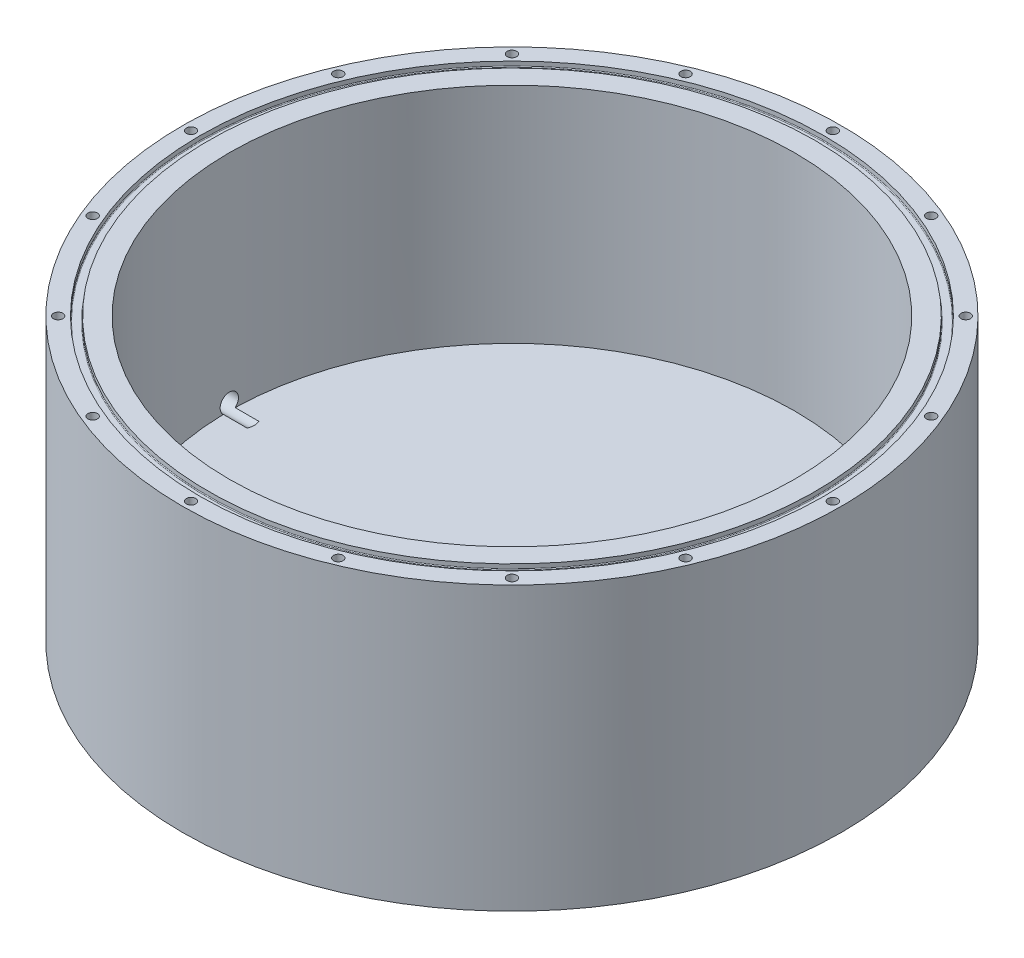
ISO-10303-21;
HEADER;
FILE_DESCRIPTION(('STEP AP214'),'2;1');
FILE_NAME('part.step','',(''),(''),'','','');
FILE_SCHEMA(('AUTOMOTIVE_DESIGN { 1 0 10303 214 1 1 1 1 }'));
ENDSEC;
DATA;
#1=APPLICATION_CONTEXT('core data for automotive mechanical design processes');
#2=APPLICATION_PROTOCOL_DEFINITION('international standard','automotive_design',2000,#1);
#3=PRODUCT_CONTEXT('',#1,'mechanical');
#4=PRODUCT('Part','Part','',(#3));
#5=PRODUCT_RELATED_PRODUCT_CATEGORY('part','',(#4));
#6=PRODUCT_DEFINITION_FORMATION('','',#4);
#7=PRODUCT_DEFINITION_CONTEXT('part definition',#1,'design');
#8=PRODUCT_DEFINITION('design','',#6,#7);
#9=PRODUCT_DEFINITION_SHAPE('','',#8);
#10=(LENGTH_UNIT() NAMED_UNIT(*) SI_UNIT(.MILLI.,.METRE.));
#11=(NAMED_UNIT(*) PLANE_ANGLE_UNIT() SI_UNIT($,.RADIAN.));
#12=(NAMED_UNIT(*) SI_UNIT($,.STERADIAN.) SOLID_ANGLE_UNIT());
#13=UNCERTAINTY_MEASURE_WITH_UNIT(LENGTH_MEASURE(1.E-05),#10,'distance_accuracy_value','');
#14=(GEOMETRIC_REPRESENTATION_CONTEXT(3) GLOBAL_UNCERTAINTY_ASSIGNED_CONTEXT((#13)) GLOBAL_UNIT_ASSIGNED_CONTEXT((#10,
#11,#12)) REPRESENTATION_CONTEXT('',''));
#15=CARTESIAN_POINT('',(0.,0.,0.));
#16=DIRECTION('',(0.,0.,1.));
#17=DIRECTION('',(1.,0.,0.));
#18=AXIS2_PLACEMENT_3D('',#15,#16,#17);
#19=CARTESIAN_POINT('',(0.,152.4,0.));
#20=DIRECTION('',(0.,-1.,0.));
#21=DIRECTION('',(0.,0.,-1.));
#22=AXIS2_PLACEMENT_3D('',#19,#20,#21);
#23=PLANE('',#22);
#24=CARTESIAN_POINT('',(-122.409871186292,152.4,-122.409871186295));
#25=DIRECTION('',(0.,1.,0.));
#26=DIRECTION('',(0.,0.,1.));
#27=AXIS2_PLACEMENT_3D('',#24,#25,#26);
#28=CIRCLE('',#27,2.55269999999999);
#29=CARTESIAN_POINT('',(-122.409871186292,152.4,-119.857171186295));
#30=VERTEX_POINT('',#29);
#31=EDGE_CURVE('E354',#30,#30,#28,.T.);
#32=ORIENTED_EDGE('',*,*,#31,.F.);
#33=EDGE_LOOP('',(#32));
#34=FACE_BOUND('',#33,.T.);
#35=CARTESIAN_POINT('',(-173.1137,152.4,-1.81326975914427E-12));
#36=DIRECTION('',(0.,1.,0.));
#37=DIRECTION('',(0.,0.,1.));
#38=AXIS2_PLACEMENT_3D('',#35,#36,#37);
#39=CIRCLE('',#38,2.55269999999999);
#40=CARTESIAN_POINT('',(-173.1137,152.4,2.55269999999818));
#41=VERTEX_POINT('',#40);
#42=EDGE_CURVE('E368',#41,#41,#39,.T.);
#43=ORIENTED_EDGE('',*,*,#42,.F.);
#44=EDGE_LOOP('',(#43));
#45=FACE_BOUND('',#44,.T.);
#46=CARTESIAN_POINT('',(-66.2477449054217,152.4,159.936204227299));
#47=DIRECTION('',(0.,1.,0.));
#48=DIRECTION('',(0.,0.,1.));
#49=AXIS2_PLACEMENT_3D('',#46,#47,#48);
#50=CIRCLE('',#49,2.55269999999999);
#51=CARTESIAN_POINT('',(-66.2477449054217,152.4,162.488904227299));
#52=VERTEX_POINT('',#51);
#53=EDGE_CURVE('E386',#52,#52,#50,.T.);
#54=ORIENTED_EDGE('',*,*,#53,.F.);
#55=EDGE_LOOP('',(#54));
#56=FACE_BOUND('',#55,.T.);
#57=CARTESIAN_POINT('',(66.2477449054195,152.4,159.9362042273));
#58=DIRECTION('',(0.,1.,0.));
#59=DIRECTION('',(0.,0.,1.));
#60=AXIS2_PLACEMENT_3D('',#57,#58,#59);
#61=CIRCLE('',#60,2.55269999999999);
#62=CARTESIAN_POINT('',(66.2477449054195,152.4,162.4889042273));
#63=VERTEX_POINT('',#62);
#64=EDGE_CURVE('E398',#63,#63,#61,.T.);
#65=ORIENTED_EDGE('',*,*,#64,.F.);
#66=EDGE_LOOP('',(#65));
#67=FACE_BOUND('',#66,.T.);
#68=CARTESIAN_POINT('',(122.409871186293,152.4,122.409871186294));
#69=DIRECTION('',(0.,1.,0.));
#70=DIRECTION('',(0.,0.,1.));
#71=AXIS2_PLACEMENT_3D('',#68,#69,#70);
#72=CIRCLE('',#71,2.55269999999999);
#73=CARTESIAN_POINT('',(122.409871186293,152.4,124.962571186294));
#74=VERTEX_POINT('',#73);
#75=EDGE_CURVE('E404',#74,#74,#72,.T.);
#76=ORIENTED_EDGE('',*,*,#75,.F.);
#77=EDGE_LOOP('',(#76));
#78=FACE_BOUND('',#77,.T.);
#79=CARTESIAN_POINT('',(0.,152.4,0.));
#80=DIRECTION('',(0.,1.,0.));
#81=DIRECTION('',(0.,0.,1.));
#82=AXIS2_PLACEMENT_3D('',#79,#80,#81);
#83=CIRCLE('',#82,177.8);
#84=CARTESIAN_POINT('',(0.,152.4,177.8));
#85=VERTEX_POINT('',#84);
#86=EDGE_CURVE('E446',#85,#85,#83,.T.);
#87=ORIENTED_EDGE('',*,*,#86,.T.);
#88=EDGE_LOOP('',(#87));
#89=FACE_BOUND('',#88,.T.);
#90=CARTESIAN_POINT('',(0.,152.4,0.));
#91=DIRECTION('',(0.,-1.,0.));
#92=DIRECTION('',(0.,0.,-1.));
#93=AXIS2_PLACEMENT_3D('',#90,#91,#92);
#94=CIRCLE('',#93,168.4274);
#95=CARTESIAN_POINT('',(0.,152.4,-168.4274));
#96=VERTEX_POINT('',#95);
#97=EDGE_CURVE('E204',#96,#96,#94,.F.);
#98=ORIENTED_EDGE('',*,*,#97,.F.);
#99=EDGE_LOOP('',(#98));
#100=FACE_BOUND('',#99,.T.);
#101=CARTESIAN_POINT('',(0.,152.4,-173.1137));
#102=DIRECTION('',(0.,1.,0.));
#103=DIRECTION('',(0.,0.,1.));
#104=AXIS2_PLACEMENT_3D('',#101,#102,#103);
#105=CIRCLE('',#104,2.55269999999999);
#106=CARTESIAN_POINT('',(0.,152.4,-170.561));
#107=VERTEX_POINT('',#106);
#108=EDGE_CURVE('E440',#107,#107,#105,.T.);
#109=ORIENTED_EDGE('',*,*,#108,.F.);
#110=EDGE_LOOP('',(#109));
#111=FACE_BOUND('',#110,.T.);
#112=CARTESIAN_POINT('',(66.2477449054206,152.4,-159.936204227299));
#113=DIRECTION('',(0.,1.,0.));
#114=DIRECTION('',(0.,0.,1.));
#115=AXIS2_PLACEMENT_3D('',#112,#113,#114);
#116=CIRCLE('',#115,2.55269999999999);
#117=CARTESIAN_POINT('',(66.2477449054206,152.4,-157.383504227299));
#118=VERTEX_POINT('',#117);
#119=EDGE_CURVE('E434',#118,#118,#116,.T.);
#120=ORIENTED_EDGE('',*,*,#119,.F.);
#121=EDGE_LOOP('',(#120));
#122=FACE_BOUND('',#121,.T.);
#123=CARTESIAN_POINT('',(122.409871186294,152.4,-122.409871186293));
#124=DIRECTION('',(0.,1.,0.));
#125=DIRECTION('',(0.,0.,1.));
#126=AXIS2_PLACEMENT_3D('',#123,#124,#125);
#127=CIRCLE('',#126,2.55269999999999);
#128=CARTESIAN_POINT('',(122.409871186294,152.4,-119.857171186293));
#129=VERTEX_POINT('',#128);
#130=EDGE_CURVE('E428',#129,#129,#127,.T.);
#131=ORIENTED_EDGE('',*,*,#130,.F.);
#132=EDGE_LOOP('',(#131));
#133=FACE_BOUND('',#132,.T.);
#134=CARTESIAN_POINT('',(159.936204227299,152.4,-66.24774490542));
#135=DIRECTION('',(0.,1.,0.));
#136=DIRECTION('',(0.,0.,1.));
#137=AXIS2_PLACEMENT_3D('',#134,#135,#136);
#138=CIRCLE('',#137,2.55269999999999);
#139=CARTESIAN_POINT('',(159.936204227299,152.4,-63.69504490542));
#140=VERTEX_POINT('',#139);
#141=EDGE_CURVE('E422',#140,#140,#138,.T.);
#142=ORIENTED_EDGE('',*,*,#141,.F.);
#143=EDGE_LOOP('',(#142));
#144=FACE_BOUND('',#143,.T.);
#145=CARTESIAN_POINT('',(173.1137,152.4,6.04423253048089E-13));
#146=DIRECTION('',(0.,1.,0.));
#147=DIRECTION('',(0.,0.,1.));
#148=AXIS2_PLACEMENT_3D('',#145,#146,#147);
#149=CIRCLE('',#148,2.55269999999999);
#150=CARTESIAN_POINT('',(173.1137,152.4,2.5527000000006));
#151=VERTEX_POINT('',#150);
#152=EDGE_CURVE('E416',#151,#151,#149,.T.);
#153=ORIENTED_EDGE('',*,*,#152,.F.);
#154=EDGE_LOOP('',(#153));
#155=FACE_BOUND('',#154,.T.);
#156=CARTESIAN_POINT('',(159.936204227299,152.4,66.2477449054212));
#157=DIRECTION('',(0.,1.,0.));
#158=DIRECTION('',(0.,0.,1.));
#159=AXIS2_PLACEMENT_3D('',#156,#157,#158);
#160=CIRCLE('',#159,2.55269999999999);
#161=CARTESIAN_POINT('',(159.936204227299,152.4,68.8004449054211));
#162=VERTEX_POINT('',#161);
#163=EDGE_CURVE('E410',#162,#162,#160,.T.);
#164=ORIENTED_EDGE('',*,*,#163,.F.);
#165=EDGE_LOOP('',(#164));
#166=FACE_BOUND('',#165,.T.);
#167=CARTESIAN_POINT('',(0.,152.4,173.1137));
#168=DIRECTION('',(0.,1.,0.));
#169=DIRECTION('',(0.,0.,1.));
#170=AXIS2_PLACEMENT_3D('',#167,#168,#169);
#171=CIRCLE('',#170,2.55269999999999);
#172=CARTESIAN_POINT('',(0.,152.4,175.6664));
#173=VERTEX_POINT('',#172);
#174=EDGE_CURVE('E392',#173,#173,#171,.T.);
#175=ORIENTED_EDGE('',*,*,#174,.F.);
#176=EDGE_LOOP('',(#175));
#177=FACE_BOUND('',#176,.T.);
#178=CARTESIAN_POINT('',(-122.409871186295,152.4,122.409871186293));
#179=DIRECTION('',(0.,1.,0.));
#180=DIRECTION('',(0.,0.,1.));
#181=AXIS2_PLACEMENT_3D('',#178,#179,#180);
#182=CIRCLE('',#181,2.55269999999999);
#183=CARTESIAN_POINT('',(-122.409871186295,152.4,124.962571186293));
#184=VERTEX_POINT('',#183);
#185=EDGE_CURVE('E380',#184,#184,#182,.T.);
#186=ORIENTED_EDGE('',*,*,#185,.F.);
#187=EDGE_LOOP('',(#186));
#188=FACE_BOUND('',#187,.T.);
#189=CARTESIAN_POINT('',(-159.9362042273,152.4,66.2477449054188));
#190=DIRECTION('',(0.,1.,0.));
#191=DIRECTION('',(0.,0.,1.));
#192=AXIS2_PLACEMENT_3D('',#189,#190,#191);
#193=CIRCLE('',#192,2.55269999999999);
#194=CARTESIAN_POINT('',(-159.9362042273,152.4,68.8004449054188));
#195=VERTEX_POINT('',#194);
#196=EDGE_CURVE('E374',#195,#195,#193,.T.);
#197=ORIENTED_EDGE('',*,*,#196,.F.);
#198=EDGE_LOOP('',(#197));
#199=FACE_BOUND('',#198,.T.);
#200=CARTESIAN_POINT('',(-159.936204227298,152.4,-66.2477449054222));
#201=DIRECTION('',(0.,1.,0.));
#202=DIRECTION('',(0.,0.,1.));
#203=AXIS2_PLACEMENT_3D('',#200,#201,#202);
#204=CIRCLE('',#203,2.55269999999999);
#205=CARTESIAN_POINT('',(-159.936204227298,152.4,-63.6950449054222));
#206=VERTEX_POINT('',#205);
#207=EDGE_CURVE('E362',#206,#206,#204,.T.);
#208=ORIENTED_EDGE('',*,*,#207,.F.);
#209=EDGE_LOOP('',(#208));
#210=FACE_BOUND('',#209,.T.);
#211=CARTESIAN_POINT('',(-66.2477449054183,152.4,-159.9362042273));
#212=DIRECTION('',(0.,1.,0.));
#213=DIRECTION('',(0.,0.,1.));
#214=AXIS2_PLACEMENT_3D('',#211,#212,#213);
#215=CIRCLE('',#214,2.55269999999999);
#216=CARTESIAN_POINT('',(-66.2477449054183,152.4,-157.3835042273));
#217=VERTEX_POINT('',#216);
#218=EDGE_CURVE('E159',#217,#217,#215,.T.);
#219=ORIENTED_EDGE('',*,*,#218,.F.);
#220=EDGE_LOOP('',(#219));
#221=FACE_BOUND('',#220,.T.);
#222=ADVANCED_FACE('F36',(#34,#45,#56,#67,#78,#89,#100,#111,#122,#133,#144,#155,#166,#177,#188,
#199,#210,#221),#23,.F.);
#223=CARTESIAN_POINT('',(0.,0.,0.));
#224=DIRECTION('',(0.,-1.,0.));
#225=DIRECTION('',(0.,0.,-1.));
#226=AXIS2_PLACEMENT_3D('',#223,#224,#225);
#227=CYLINDRICAL_SURFACE('',#226,163.8046);
#228=CARTESIAN_POINT('',(0.,152.4,0.));
#229=DIRECTION('',(0.,-1.,0.));
#230=DIRECTION('',(0.,0.,-1.));
#231=AXIS2_PLACEMENT_3D('',#228,#229,#230);
#232=CIRCLE('',#231,163.8046);
#233=CARTESIAN_POINT('',(0.,152.4,-163.8046));
#234=VERTEX_POINT('',#233);
#235=EDGE_CURVE('E191',#234,#234,#232,.T.);
#236=ORIENTED_EDGE('',*,*,#235,.T.);
#237=EDGE_LOOP('',(#236));
#238=FACE_BOUND('',#237,.T.);
#239=CARTESIAN_POINT('',(0.,150.1648,0.));
#240=DIRECTION('',(0.,-1.,0.));
#241=DIRECTION('',(0.,0.,-1.));
#242=AXIS2_PLACEMENT_3D('',#239,#240,#241);
#243=CIRCLE('',#242,163.8046);
#244=CARTESIAN_POINT('',(0.,150.1648,-163.8046));
#245=VERTEX_POINT('',#244);
#246=EDGE_CURVE('E192',#245,#245,#243,.T.);
#247=ORIENTED_EDGE('',*,*,#246,.F.);
#248=EDGE_LOOP('',(#247));
#249=FACE_BOUND('',#248,.T.);
#250=ADVANCED_FACE('F152',(#238,#249),#227,.T.);
#251=CARTESIAN_POINT('',(0.,150.1648,0.));
#252=DIRECTION('',(0.,-1.,0.));
#253=DIRECTION('',(0.,0.,-1.));
#254=AXIS2_PLACEMENT_3D('',#251,#252,#253);
#255=TOROIDAL_SURFACE('',#254,164.211,0.406399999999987);
#256=ORIENTED_EDGE('',*,*,#246,.T.);
#257=EDGE_LOOP('',(#256));
#258=FACE_BOUND('',#257,.T.);
#259=CARTESIAN_POINT('',(0.,149.7584,0.));
#260=DIRECTION('',(0.,-1.,0.));
#261=DIRECTION('',(0.,0.,-1.));
#262=AXIS2_PLACEMENT_3D('',#259,#260,#261);
#263=CIRCLE('',#262,164.211);
#264=CARTESIAN_POINT('',(0.,149.7584,-164.211));
#265=VERTEX_POINT('',#264);
#266=EDGE_CURVE('E195',#265,#265,#263,.T.);
#267=ORIENTED_EDGE('',*,*,#266,.F.);
#268=EDGE_LOOP('',(#267));
#269=FACE_BOUND('',#268,.T.);
#270=ADVANCED_FACE('F173',(#258,#269),#255,.F.);
#271=CARTESIAN_POINT('',(-168.021,149.7584,0.));
#272=DIRECTION('',(0.,1.,0.));
#273=DIRECTION('',(0.,0.,1.));
#274=AXIS2_PLACEMENT_3D('',#271,#272,#273);
#275=PLANE('',#274);
#276=ORIENTED_EDGE('',*,*,#266,.T.);
#277=EDGE_LOOP('',(#276));
#278=FACE_BOUND('',#277,.T.);
#279=CARTESIAN_POINT('',(0.,149.7584,0.));
#280=DIRECTION('',(0.,-1.,0.));
#281=DIRECTION('',(0.,0.,-1.));
#282=AXIS2_PLACEMENT_3D('',#279,#280,#281);
#283=CIRCLE('',#282,168.021);
#284=CARTESIAN_POINT('',(0.,149.7584,-168.021));
#285=VERTEX_POINT('',#284);
#286=EDGE_CURVE('E202',#285,#285,#283,.T.);
#287=ORIENTED_EDGE('',*,*,#286,.F.);
#288=EDGE_LOOP('',(#287));
#289=FACE_BOUND('',#288,.T.);
#290=ADVANCED_FACE('F455',(#278,#289),#275,.T.);
#291=CARTESIAN_POINT('',(0.,150.1648,0.));
#292=DIRECTION('',(0.,-1.,0.));
#293=DIRECTION('',(0.,0.,-1.));
#294=AXIS2_PLACEMENT_3D('',#291,#292,#293);
#295=TOROIDAL_SURFACE('',#294,168.021,0.406400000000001);
#296=ORIENTED_EDGE('',*,*,#286,.T.);
#297=EDGE_LOOP('',(#296));
#298=FACE_BOUND('',#297,.T.);
#299=CARTESIAN_POINT('',(0.,150.1648,0.));
#300=DIRECTION('',(0.,-1.,0.));
#301=DIRECTION('',(0.,0.,-1.));
#302=AXIS2_PLACEMENT_3D('',#299,#300,#301);
#303=CIRCLE('',#302,168.4274);
#304=CARTESIAN_POINT('',(0.,150.1648,-168.4274));
#305=VERTEX_POINT('',#304);
#306=EDGE_CURVE('E449',#305,#305,#303,.T.);
#307=ORIENTED_EDGE('',*,*,#306,.F.);
#308=EDGE_LOOP('',(#307));
#309=FACE_BOUND('',#308,.T.);
#310=ADVANCED_FACE('F183',(#298,#309),#295,.F.);
#311=CARTESIAN_POINT('',(0.,0.,0.));
#312=DIRECTION('',(0.,-1.,0.));
#313=DIRECTION('',(0.,0.,-1.));
#314=AXIS2_PLACEMENT_3D('',#311,#312,#313);
#315=CYLINDRICAL_SURFACE('',#314,168.4274);
#316=ORIENTED_EDGE('',*,*,#306,.T.);
#317=EDGE_LOOP('',(#316));
#318=FACE_BOUND('',#317,.T.);
#319=ORIENTED_EDGE('',*,*,#97,.T.);
#320=EDGE_LOOP('',(#319));
#321=FACE_BOUND('',#320,.T.);
#322=ADVANCED_FACE('F146',(#318,#321),#315,.F.);
#323=CARTESIAN_POINT('',(0.,152.4,0.));
#324=DIRECTION('',(0.,-1.,0.));
#325=DIRECTION('',(0.,0.,-1.));
#326=AXIS2_PLACEMENT_3D('',#323,#324,#325);
#327=CIRCLE('',#326,152.54);
#328=CARTESIAN_POINT('',(0.,152.4,-152.54));
#329=VERTEX_POINT('',#328);
#330=EDGE_CURVE('E188',#329,#329,#327,.T.);
#331=ORIENTED_EDGE('',*,*,#330,.T.);
#332=EDGE_LOOP('',(#331));
#333=FACE_BOUND('',#332,.T.);
#334=ORIENTED_EDGE('',*,*,#235,.F.);
#335=EDGE_LOOP('',(#334));
#336=FACE_BOUND('',#335,.T.);
#337=ADVANCED_FACE('F150',(#333,#336),#23,.F.);
#338=CARTESIAN_POINT('',(0.,0.,0.));
#339=DIRECTION('',(0.,-1.,0.));
#340=DIRECTION('',(0.,0.,-1.));
#341=AXIS2_PLACEMENT_3D('',#338,#339,#340);
#342=CYLINDRICAL_SURFACE('',#341,152.54);
#343=CARTESIAN_POINT('',(-152.50691770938,31.7499999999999,-3.17673586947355));
#344=CARTESIAN_POINT('',(-152.504685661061,31.8393353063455,-3.2839029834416));
#345=CARTESIAN_POINT('',(-152.502419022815,31.9332121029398,-3.38727992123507));
#346=CARTESIAN_POINT('',(-152.497881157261,32.129329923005,-3.58576031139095));
#347=CARTESIAN_POINT('',(-152.495609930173,32.2315705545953,-3.68086415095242));
#348=CARTESIAN_POINT('',(-152.491128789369,32.4436332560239,-3.86205340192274));
#349=CARTESIAN_POINT('',(-152.488918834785,32.5534500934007,-3.94814493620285));
#350=CARTESIAN_POINT('',(-152.484621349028,32.7799433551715,-4.1107748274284));
#351=CARTESIAN_POINT('',(-152.482533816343,32.8966196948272,-4.1873133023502));
#352=CARTESIAN_POINT('',(-152.478539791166,33.1360412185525,-4.33031454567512));
#353=CARTESIAN_POINT('',(-152.476633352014,33.2587881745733,-4.39677434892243));
#354=CARTESIAN_POINT('',(-152.473055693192,33.5094935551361,-4.51914126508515));
#355=CARTESIAN_POINT('',(-152.471384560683,33.6374538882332,-4.57504447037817));
#356=CARTESIAN_POINT('',(-152.468326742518,33.8975589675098,-4.67584036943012));
#357=CARTESIAN_POINT('',(-152.466939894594,34.0297012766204,-4.72073934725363));
#358=CARTESIAN_POINT('',(-152.464488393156,34.297350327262,-4.79926287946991));
#359=CARTESIAN_POINT('',(-152.46342385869,34.4328582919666,-4.83288326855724));
#360=CARTESIAN_POINT('',(-152.46164852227,34.7061395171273,-4.88856896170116));
#361=CARTESIAN_POINT('',(-152.460937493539,34.8439112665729,-4.91064167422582));
#362=CARTESIAN_POINT('',(-152.459888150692,35.1208767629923,-4.94311336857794));
#363=CARTESIAN_POINT('',(-152.4595499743,35.2600710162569,-4.95350803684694));
#364=CARTESIAN_POINT('',(-152.459256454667,35.5388103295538,-4.9625338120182));
#365=CARTESIAN_POINT('',(-152.459301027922,35.6783553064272,-4.9611674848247));
#366=CARTESIAN_POINT('',(-152.459771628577,35.9568852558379,-4.94668446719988));
#367=CARTESIAN_POINT('',(-152.460197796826,36.0958700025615,-4.93356343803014));
#368=CARTESIAN_POINT('',(-152.461419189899,36.3721318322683,-4.89567326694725));
#369=CARTESIAN_POINT('',(-152.462214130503,36.5094101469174,-4.87091309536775));
#370=CARTESIAN_POINT('',(-152.464150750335,36.7814428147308,-4.80991334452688));
#371=CARTESIAN_POINT('',(-152.465292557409,36.9161962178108,-4.77366953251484));
#372=CARTESIAN_POINT('',(-152.467889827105,37.182112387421,-4.68998097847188));
#373=CARTESIAN_POINT('',(-152.469345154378,37.3132766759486,-4.64254106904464));
#374=CARTESIAN_POINT('',(-152.472528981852,37.5711894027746,-4.53677253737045));
#375=CARTESIAN_POINT('',(-152.474257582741,37.6979361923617,-4.47843990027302));
#376=CARTESIAN_POINT('',(-152.477938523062,37.9460568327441,-4.35131039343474));
#377=CARTESIAN_POINT('',(-152.47989083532,38.067431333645,-4.28251479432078));
#378=CARTESIAN_POINT('',(-152.483963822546,38.3039733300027,-4.13495229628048));
#379=CARTESIAN_POINT('',(-152.486084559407,38.4191385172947,-4.05618172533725));
#380=CARTESIAN_POINT('',(-152.492608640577,38.7539756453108,-3.80575342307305));
#381=CARTESIAN_POINT('',(-152.497177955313,38.963252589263,-3.61984382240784));
#382=CARTESIAN_POINT('',(-152.506238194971,39.3476073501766,-3.21554472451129));
#383=CARTESIAN_POINT('',(-152.510729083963,39.522669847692,-2.99714075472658));
#384=CARTESIAN_POINT('',(-152.519126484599,39.8336759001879,-2.5340084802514));
#385=CARTESIAN_POINT('',(-152.523032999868,39.9696196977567,-2.28928033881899));
#386=CARTESIAN_POINT('',(-152.529820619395,40.1984797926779,-1.78047379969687));
#387=CARTESIAN_POINT('',(-152.532701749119,40.2913971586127,-1.51639588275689));
#388=CARTESIAN_POINT('',(-152.537114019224,40.4315761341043,-0.976375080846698));
#389=CARTESIAN_POINT('',(-152.53864516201,40.4788378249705,-0.700432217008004));
#390=CARTESIAN_POINT('',(-152.540184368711,40.5263445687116,-0.144654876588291));
#391=CARTESIAN_POINT('',(-152.540193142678,40.5266115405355,0.135177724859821));
#392=CARTESIAN_POINT('',(-152.538688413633,40.4801763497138,0.690914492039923));
#393=CARTESIAN_POINT('',(-152.537174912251,40.4334742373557,0.96681866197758));
#394=CARTESIAN_POINT('',(-152.532796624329,40.2944462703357,1.50681563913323));
#395=CARTESIAN_POINT('',(-152.529932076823,40.2021284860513,1.77091052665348));
#396=CARTESIAN_POINT('',(-152.523174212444,39.9744856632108,2.27986017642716));
#397=CARTESIAN_POINT('',(-152.519280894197,39.8391605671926,2.52471491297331));
#398=CARTESIAN_POINT('',(-152.510902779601,39.529327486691,2.98831039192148));
#399=CARTESIAN_POINT('',(-152.506417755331,39.3548043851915,3.20704100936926));
#400=CARTESIAN_POINT('',(-152.49736026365,38.9713880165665,3.61218139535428));
#401=CARTESIAN_POINT('',(-152.492787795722,38.7624945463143,3.79859097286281));
#402=CARTESIAN_POINT('',(-152.486253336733,38.4281207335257,4.04983798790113));
#403=CARTESIAN_POINT('',(-152.484127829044,38.3130679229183,4.1289051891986));
#404=CARTESIAN_POINT('',(-152.480043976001,38.0767221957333,4.27706383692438));
#405=CARTESIAN_POINT('',(-152.478085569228,37.9554315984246,4.3461589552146));
#406=CARTESIAN_POINT('',(-152.474390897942,37.707420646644,4.47390321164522));
#407=CARTESIAN_POINT('',(-152.472654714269,37.580698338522,4.53254855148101));
#408=CARTESIAN_POINT('',(-152.469455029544,37.3228050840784,4.63893469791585));
#409=CARTESIAN_POINT('',(-152.467991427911,37.1916357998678,4.68667952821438));
#410=CARTESIAN_POINT('',(-152.465377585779,36.925719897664,4.770955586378));
#411=CARTESIAN_POINT('',(-152.464227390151,36.7909727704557,4.80748520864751));
#412=CARTESIAN_POINT('',(-152.462273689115,36.5189275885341,4.86905030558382));
#413=CARTESIAN_POINT('',(-152.461470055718,36.3816304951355,4.89409002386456));
#414=CARTESIAN_POINT('',(-152.460231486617,36.1053641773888,4.93252326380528));
#415=CARTESIAN_POINT('',(-152.459796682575,35.9663943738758,4.94591262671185));
#416=CARTESIAN_POINT('',(-152.459308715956,35.6878716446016,4.96093162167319));
#417=CARTESIAN_POINT('',(-152.459255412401,35.5483189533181,4.96256559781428));
#418=CARTESIAN_POINT('',(-152.459531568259,35.2695934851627,4.95407426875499));
#419=CARTESIAN_POINT('',(-152.459860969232,35.1304206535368,4.9439507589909));
#420=CARTESIAN_POINT('',(-152.460892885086,34.85347449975,4.91202554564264));
#421=CARTESIAN_POINT('',(-152.461595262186,34.7157006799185,4.89022815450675));
#422=CARTESIAN_POINT('',(-152.463353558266,34.4424083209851,4.835098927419));
#423=CARTESIAN_POINT('',(-152.464409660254,34.3068909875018,4.80176112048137));
#424=CARTESIAN_POINT('',(-152.466844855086,34.0391977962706,4.72380551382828));
#425=CARTESIAN_POINT('',(-152.468223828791,33.9070207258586,4.67919187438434));
#426=CARTESIAN_POINT('',(-152.471267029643,33.6467924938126,4.57895669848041));
#427=CARTESIAN_POINT('',(-152.472931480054,33.5187446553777,4.52332654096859));
#428=CARTESIAN_POINT('',(-152.476496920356,33.2678404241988,4.40149941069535));
#429=CARTESIAN_POINT('',(-152.478397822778,33.1449821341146,4.33530634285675));
#430=CARTESIAN_POINT('',(-152.482381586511,32.9053452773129,4.19284838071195));
#431=CARTESIAN_POINT('',(-152.48446434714,32.7885634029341,4.11658904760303));
#432=CARTESIAN_POINT('',(-152.488752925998,32.5618736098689,3.95454136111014));
#433=CARTESIAN_POINT('',(-152.490958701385,32.4519633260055,3.86875631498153));
#434=CARTESIAN_POINT('',(-152.495465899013,32.2381225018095,3.68685160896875));
#435=CARTESIAN_POINT('',(-152.497768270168,32.134309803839,3.59059339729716));
#436=CARTESIAN_POINT('',(-152.5023648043,31.9354577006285,3.38975221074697));
#437=CARTESIAN_POINT('',(-152.504658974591,31.8404027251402,3.28518465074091));
#438=CARTESIAN_POINT('',(-152.50691770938,31.7499999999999,3.17673586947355));
#439=B_SPLINE_CURVE_WITH_KNOTS('',3,(#343,#344,#345,#346,#347,#348,#349,#350,#351,#352,#353,
#354,#355,#356,#357,#358,#359,#360,#361,#362,#363,#364,#365,#366,#367,#368,#369,#370,#371,#372,
#373,#374,#375,#376,#377,#378,#379,#380,#381,#382,#383,#384,#385,#386,#387,#388,#389,#390,#391,
#392,#393,#394,#395,#396,#397,#398,#399,#400,#401,#402,#403,#404,#405,#406,#407,#408,#409,#410,
#411,#412,#413,#414,#415,#416,#417,#418,#419,#420,#421,#422,#423,#424,#425,#426,#427,#428,#429,
#430,#431,#432,#433,#434,#435,#436,#437,#438),.UNSPECIFIED.,.F.,.F.,(4,2,2,2,2,2,2,2,2,2,2,2,2,
2,2,2,2,2,2,2,2,2,2,2,2,2,2,2,2,2,2,2,2,2,2,2,2,2,2,2,2,2,2,2,2,2,2,4),(0.,0.418483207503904,
0.83694681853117,1.25512425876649,1.67329653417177,2.0915915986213,2.51004119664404,
2.92825127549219,3.34661563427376,3.7647112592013,4.18296126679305,4.60112002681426,
5.01943319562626,5.43742449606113,5.85557004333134,6.27353543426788,6.69165518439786,
7.10972419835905,7.52794756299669,8.36351697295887,9.19945965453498,10.035397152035,
10.8713138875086,11.7072291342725,12.5427544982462,13.3782789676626,14.2136556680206,
15.0490334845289,15.8847340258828,16.7204395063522,17.1388875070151,17.5571810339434,
17.9756262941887,18.393916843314,18.8122672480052,19.230463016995,19.6488080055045,
20.0669983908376,20.4851249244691,20.9030971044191,21.3212858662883,21.7393205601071,
22.1576836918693,22.5758925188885,22.993871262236,23.4117053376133,23.8359601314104,
24.2594454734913),.UNSPECIFIED.);
#440=CARTESIAN_POINT('',(-152.50691770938,31.7499999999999,-3.17673586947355));
#441=VERTEX_POINT('',#440);
#442=CARTESIAN_POINT('',(-152.50691770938,31.7499999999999,3.17673586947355));
#443=VERTEX_POINT('',#442);
#444=EDGE_CURVE('E124',#441,#443,#439,.T.);
#445=ORIENTED_EDGE('',*,*,#444,.F.);
#446=CARTESIAN_POINT('',(0.,31.7499999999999,0.));
#447=DIRECTION('',(0.,-1.,0.));
#448=DIRECTION('',(0.,0.,-1.));
#449=AXIS2_PLACEMENT_3D('',#446,#447,#448);
#450=CIRCLE('',#449,152.54);
#451=EDGE_CURVE('E129',#441,#443,#450,.T.);
#452=ORIENTED_EDGE('',*,*,#451,.T.);
#453=EDGE_LOOP('',(#445,#452));
#454=FACE_BOUND('',#453,.T.);
#455=ORIENTED_EDGE('',*,*,#330,.F.);
#456=EDGE_LOOP('',(#455));
#457=FACE_BOUND('',#456,.T.);
#458=ADVANCED_FACE('F145',(#454,#457),#342,.F.);
#459=CARTESIAN_POINT('',(-152.54,31.7499999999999,0.));
#460=DIRECTION('',(0.,1.,0.));
#461=DIRECTION('',(0.,0.,1.));
#462=AXIS2_PLACEMENT_3D('',#459,#460,#461);
#463=PLANE('',#462);
#464=DIRECTION('',(-1.,0.,0.));
#465=VECTOR('',#464,1.);
#466=CARTESIAN_POINT('',(-177.8,31.7499999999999,-3.17673586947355));
#467=LINE('',#466,#465);
#468=CARTESIAN_POINT('',(-139.7,31.7499999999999,-3.17673586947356));
#469=VERTEX_POINT('',#468);
#470=EDGE_CURVE('E48',#469,#441,#467,.T.);
#471=ORIENTED_EDGE('',*,*,#470,.F.);
#472=CARTESIAN_POINT('',(-151.803468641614,31.7499999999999,-24.8133729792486));
#473=CARTESIAN_POINT('',(-151.373428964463,31.7499999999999,-24.08924255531));
#474=CARTESIAN_POINT('',(-150.943679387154,31.7499999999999,-23.3649394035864));
#475=CARTESIAN_POINT('',(-150.084806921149,31.7499999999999,-21.9154579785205));
#476=CARTESIAN_POINT('',(-149.655684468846,31.7499999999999,-21.1902794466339));
#477=CARTESIAN_POINT('',(-148.794458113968,31.7499999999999,-19.7323254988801));
#478=CARTESIAN_POINT('',(-148.362364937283,31.7499999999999,-18.9995437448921));
#479=CARTESIAN_POINT('',(-147.499984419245,31.7499999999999,-17.5334216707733));
#480=CARTESIAN_POINT('',(-147.069696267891,31.7499999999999,-16.8000818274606));
#481=CARTESIAN_POINT('',(-146.324358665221,31.7499999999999,-15.525222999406));
#482=CARTESIAN_POINT('',(-146.008782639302,31.7499999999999,-14.9840119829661));
#483=CARTESIAN_POINT('',(-145.379318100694,31.7499999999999,-13.9005719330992));
#484=CARTESIAN_POINT('',(-145.065429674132,31.7499999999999,-13.3583428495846));
#485=CARTESIAN_POINT('',(-144.439472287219,31.7499999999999,-12.271511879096));
#486=CARTESIAN_POINT('',(-144.127407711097,31.7499999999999,-11.7269074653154));
#487=CARTESIAN_POINT('',(-143.506831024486,31.7499999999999,-10.6358090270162));
#488=CARTESIAN_POINT('',(-143.198318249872,31.7499999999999,-10.0893153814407));
#489=CARTESIAN_POINT('',(-142.740811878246,31.7499999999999,-9.2694115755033));
#490=CARTESIAN_POINT('',(-142.589766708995,31.7499999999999,-8.99714679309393));
#491=CARTESIAN_POINT('',(-142.289399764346,31.7499999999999,-8.45166902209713));
#492=CARTESIAN_POINT('',(-142.140077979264,31.7499999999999,-8.17845603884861));
#493=CARTESIAN_POINT('',(-141.843547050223,31.7499999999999,-7.63061179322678));
#494=CARTESIAN_POINT('',(-141.696339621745,31.7499999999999,-7.35597960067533));
#495=CARTESIAN_POINT('',(-141.404886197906,31.7499999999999,-6.80515854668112));
#496=CARTESIAN_POINT('',(-141.260640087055,31.7499999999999,-6.52896974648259));
#497=CARTESIAN_POINT('',(-140.976657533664,31.7499999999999,-5.97549841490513));
#498=CARTESIAN_POINT('',(-140.836907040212,31.7499999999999,-5.69822312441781));
#499=CARTESIAN_POINT('',(-140.562942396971,31.7499999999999,-5.14087888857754));
#500=CARTESIAN_POINT('',(-140.428729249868,31.7499999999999,-4.86080944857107));
#501=CARTESIAN_POINT('',(-140.168445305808,31.7499999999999,-4.29731291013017));
#502=CARTESIAN_POINT('',(-140.04236388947,31.7499999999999,-4.01389078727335));
#503=CARTESIAN_POINT('',(-139.862175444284,31.7499999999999,-3.58505524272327));
#504=CARTESIAN_POINT('',(-139.803610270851,31.7499999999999,-3.44151636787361));
#505=CARTESIAN_POINT('',(-139.690160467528,31.7499999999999,-3.15299572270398));
#506=CARTESIAN_POINT('',(-139.635275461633,31.7499999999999,-3.00801410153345));
#507=CARTESIAN_POINT('',(-139.564029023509,31.7499999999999,-2.81059463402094));
#508=CARTESIAN_POINT('',(-139.545683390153,31.7499999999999,-2.75886974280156));
#509=CARTESIAN_POINT('',(-139.50960551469,31.7499999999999,-2.65520323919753));
#510=CARTESIAN_POINT('',(-139.491873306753,31.7499999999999,-2.60326161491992));
#511=CARTESIAN_POINT('',(-139.439663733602,31.7499999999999,-2.44709300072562));
#512=CARTESIAN_POINT('',(-139.406176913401,31.7499999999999,-2.34253190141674));
#513=CARTESIAN_POINT('',(-139.342269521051,31.7499999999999,-2.13250109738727));
#514=CARTESIAN_POINT('',(-139.311848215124,31.7499999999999,-2.02703161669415));
#515=CARTESIAN_POINT('',(-139.254525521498,31.7499999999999,-1.81513516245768));
#516=CARTESIAN_POINT('',(-139.227624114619,31.7499999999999,-1.70870819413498));
#517=CARTESIAN_POINT('',(-139.178564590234,31.7499999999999,-1.49803478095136));
#518=CARTESIAN_POINT('',(-139.15629091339,31.7499999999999,-1.39381539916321));
#519=CARTESIAN_POINT('',(-139.115990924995,31.7499999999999,-1.1845562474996));
#520=CARTESIAN_POINT('',(-139.097964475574,31.7499999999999,-1.07951650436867));
#521=CARTESIAN_POINT('',(-139.066590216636,31.7499999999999,-0.868717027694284));
#522=CARTESIAN_POINT('',(-139.053243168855,31.7499999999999,-0.762957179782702));
#523=CARTESIAN_POINT('',(-139.031595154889,31.7499999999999,-0.550922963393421));
#524=CARTESIAN_POINT('',(-139.02329402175,31.7499999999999,-0.444648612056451));
#525=CARTESIAN_POINT('',(-139.011047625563,31.7499999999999,-0.21411695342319));
#526=CARTESIAN_POINT('',(-139.008055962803,31.7499999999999,-0.089807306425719));
#527=CARTESIAN_POINT('',(-139.009407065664,31.7499999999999,0.158773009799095));
#528=CARTESIAN_POINT('',(-139.013750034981,31.7499999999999,0.283043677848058));
#529=CARTESIAN_POINT('',(-139.029585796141,31.7499999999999,0.531121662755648));
#530=CARTESIAN_POINT('',(-139.041078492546,31.7499999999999,0.654928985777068));
#531=CARTESIAN_POINT('',(-139.070758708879,31.7499999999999,0.901732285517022));
#532=CARTESIAN_POINT('',(-139.088946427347,31.7499999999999,1.02472823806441));
#533=CARTESIAN_POINT('',(-139.131986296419,31.7499999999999,1.2731790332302));
#534=CARTESIAN_POINT('',(-139.157014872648,31.7499999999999,1.39860302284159));
#535=CARTESIAN_POINT('',(-139.212690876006,31.7499999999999,1.64818847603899));
#536=CARTESIAN_POINT('',(-139.243338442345,31.7499999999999,1.77234990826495));
#537=CARTESIAN_POINT('',(-139.309477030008,31.7499999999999,2.01943415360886));
#538=CARTESIAN_POINT('',(-139.344970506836,31.7499999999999,2.14235630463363));
#539=CARTESIAN_POINT('',(-139.420056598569,31.7499999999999,2.38692471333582));
#540=CARTESIAN_POINT('',(-139.459648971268,31.7499999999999,2.50857104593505));
#541=CARTESIAN_POINT('',(-139.57682158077,31.7499999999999,2.85190276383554));
#542=CARTESIAN_POINT('',(-139.658486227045,31.7499999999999,3.07219352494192));
#543=CARTESIAN_POINT('',(-139.830241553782,31.7499999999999,3.50948595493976));
#544=CARTESIAN_POINT('',(-139.920334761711,31.7499999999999,3.72648661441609));
#545=CARTESIAN_POINT('',(-140.106784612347,31.7499999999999,4.15802675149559));
#546=CARTESIAN_POINT('',(-140.203147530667,31.7499999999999,4.37256350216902));
#547=CARTESIAN_POINT('',(-140.400457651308,31.7499999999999,4.79947710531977));
#548=CARTESIAN_POINT('',(-140.501404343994,31.7499999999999,5.01185419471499));
#549=CARTESIAN_POINT('',(-140.707147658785,31.7499999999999,5.43567721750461));
#550=CARTESIAN_POINT('',(-140.811956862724,31.7499999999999,5.64711702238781));
#551=CARTESIAN_POINT('',(-141.024275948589,31.7499999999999,6.06863856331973));
#552=CARTESIAN_POINT('',(-141.131785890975,31.7499999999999,6.27872026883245));
#553=CARTESIAN_POINT('',(-141.348855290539,31.7499999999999,6.69766478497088));
#554=CARTESIAN_POINT('',(-141.458413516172,31.7499999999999,6.90652823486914));
#555=CARTESIAN_POINT('',(-141.679211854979,31.7499999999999,7.32336494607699));
#556=CARTESIAN_POINT('',(-141.790451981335,31.7499999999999,7.53133820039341));
#557=CARTESIAN_POINT('',(-142.097012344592,31.7499999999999,8.10003069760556));
#558=CARTESIAN_POINT('',(-142.293697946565,31.7499999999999,8.46001357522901));
#559=CARTESIAN_POINT('',(-142.689983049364,31.7499999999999,9.17844306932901));
#560=CARTESIAN_POINT('',(-142.88958301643,31.7499999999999,9.53688942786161));
#561=CARTESIAN_POINT('',(-143.28940024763,31.7499999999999,10.2499292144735));
#562=CARTESIAN_POINT('',(-143.489601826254,31.7499999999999,10.6045314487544));
#563=CARTESIAN_POINT('',(-143.891568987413,31.7499999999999,11.3127598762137));
#564=CARTESIAN_POINT('',(-144.093334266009,31.7499999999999,11.6663862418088));
#565=CARTESIAN_POINT('',(-144.295660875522,31.7499999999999,12.0196880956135));
#566=B_SPLINE_CURVE_WITH_KNOTS('',3,(#472,#473,#474,#475,#476,#477,#478,#479,#480,#481,#482,
#483,#484,#485,#486,#487,#488,#489,#490,#491,#492,#493,#494,#495,#496,#497,#498,#499,#500,#501,
#502,#503,#504,#505,#506,#507,#508,#509,#510,#511,#512,#513,#514,#515,#516,#517,#518,#519,#520,
#521,#522,#523,#524,#525,#526,#527,#528,#529,#530,#531,#532,#533,#534,#535,#536,#537,#538,#539,
#540,#541,#542,#543,#544,#545,#546,#547,#548,#549,#550,#551,#552,#553,#554,#555,#556,#557,#558,
#559,#560,#561,#562,#563,#564,#565),.UNSPECIFIED.,.F.,.F.,(4,2,2,2,2,2,2,2,2,2,2,2,2,2,2,2,2,2,
2,2,2,2,2,2,2,2,2,2,2,2,2,2,2,2,2,2,2,2,2,2,2,2,2,2,2,2,4),(0.,2.52659723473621,5.0544948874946,
7.60656384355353,10.1573286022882,12.0368153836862,13.9163971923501,15.7994208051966,
17.6820864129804,18.6161507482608,19.5502098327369,20.4849882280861,21.4197300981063,
22.3511912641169,23.2828203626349,24.213207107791,24.6782510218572,25.1432473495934,
25.3078899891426,25.4725417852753,25.8018761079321,26.131131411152,26.4603849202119,
26.780025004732,27.0996547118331,27.4193364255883,27.7390075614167,28.1118240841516,
28.4846509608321,28.857472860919,29.2303058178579,29.6138482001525,29.9974000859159,
30.3811470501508,30.7648713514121,31.4694230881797,32.174186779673,32.8796670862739,
33.5850691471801,34.2930175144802,35.0009817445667,35.7085331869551,36.4160901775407,
37.6467014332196,38.8775117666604,40.0991497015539,41.3205558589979),.UNSPECIFIED.);
#567=CARTESIAN_POINT('',(-139.7,31.7499999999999,3.17673586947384));
#568=VERTEX_POINT('',#567);
#569=EDGE_CURVE('E112',#568,#469,#566,.F.);
#570=ORIENTED_EDGE('',*,*,#569,.F.);
#571=DIRECTION('',(-1.,0.,0.));
#572=VECTOR('',#571,1.);
#573=CARTESIAN_POINT('',(-177.8,31.7499999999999,3.17673586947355));
#574=LINE('',#573,#572);
#575=EDGE_CURVE('E117',#443,#568,#574,.F.);
#576=ORIENTED_EDGE('',*,*,#575,.F.);
#577=ORIENTED_EDGE('',*,*,#451,.F.);
#578=EDGE_LOOP('',(#471,#570,#576,#577));
#579=FACE_BOUND('',#578,.T.);
#580=ADVANCED_FACE('F127',(#579),#463,.T.);
#581=CARTESIAN_POINT('',(0.,0.,0.));
#582=DIRECTION('',(0.,1.,0.));
#583=DIRECTION('',(0.,0.,1.));
#584=AXIS2_PLACEMENT_3D('',#581,#582,#583);
#585=CYLINDRICAL_SURFACE('',#584,177.8);
#586=CARTESIAN_POINT('',(-177.730785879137,35.5599999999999,4.96061999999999));
#587=CARTESIAN_POINT('',(-177.730785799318,35.6993410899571,4.96062102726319));
#588=CARTESIAN_POINT('',(-177.730950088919,35.8386654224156,4.95474658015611));
#589=CARTESIAN_POINT('',(-177.73160248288,36.1163699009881,4.93128999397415));
#590=CARTESIAN_POINT('',(-177.732090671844,36.254749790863,4.91370479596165));
#591=CARTESIAN_POINT('',(-177.733377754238,36.5296557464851,4.86692695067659));
#592=CARTESIAN_POINT('',(-177.734176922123,36.6661800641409,4.83772404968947));
#593=CARTESIAN_POINT('',(-177.736063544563,36.9363308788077,4.76790672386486));
#594=CARTESIAN_POINT('',(-177.737151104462,37.069956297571,4.72728812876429));
#595=CARTESIAN_POINT('',(-177.739582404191,37.3331929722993,4.63497303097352));
#596=CARTESIAN_POINT('',(-177.740925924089,37.4628075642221,4.58328603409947));
#597=CARTESIAN_POINT('',(-177.743832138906,37.7172685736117,4.46916031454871));
#598=CARTESIAN_POINT('',(-177.745394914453,37.8421132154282,4.40671763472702));
#599=CARTESIAN_POINT('',(-177.748693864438,38.0860215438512,4.27157962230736));
#600=CARTESIAN_POINT('',(-177.750429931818,38.2050887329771,4.19889060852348));
#601=CARTESIAN_POINT('',(-177.754027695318,38.4367221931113,4.04371864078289));
#602=CARTESIAN_POINT('',(-177.755889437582,38.5492860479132,3.96123208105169));
#603=CARTESIAN_POINT('',(-177.759685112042,38.767063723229,3.78707435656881));
#604=CARTESIAN_POINT('',(-177.761619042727,38.8722776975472,3.69540338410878));
#605=CARTESIAN_POINT('',(-177.765504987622,39.074648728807,3.5034908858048));
#606=CARTESIAN_POINT('',(-177.767457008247,39.1718027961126,3.40324620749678));
#607=CARTESIAN_POINT('',(-177.771322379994,39.3572897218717,3.19496197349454));
#608=CARTESIAN_POINT('',(-177.773235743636,39.4456254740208,3.08692499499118));
#609=CARTESIAN_POINT('',(-177.776970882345,39.6129156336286,2.86375296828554));
#610=CARTESIAN_POINT('',(-177.778792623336,39.6918665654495,2.74861531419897));
#611=CARTESIAN_POINT('',(-177.782291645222,39.8397711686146,2.51212168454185));
#612=CARTESIAN_POINT('',(-177.783968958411,39.9087270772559,2.39076710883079));
#613=CARTESIAN_POINT('',(-177.787132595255,40.0361957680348,2.14263557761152));
#614=CARTESIAN_POINT('',(-177.78861884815,40.094704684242,2.01585663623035));
#615=CARTESIAN_POINT('',(-177.791356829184,40.2008119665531,1.75785471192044));
#616=CARTESIAN_POINT('',(-177.792608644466,40.2484143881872,1.6266334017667));
#617=CARTESIAN_POINT('',(-177.794843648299,40.3324117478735,1.36063491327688));
#618=CARTESIAN_POINT('',(-177.795826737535,40.368802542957,1.2258564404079));
#619=CARTESIAN_POINT('',(-177.798326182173,40.4606646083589,0.817782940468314));
#620=CARTESIAN_POINT('',(-177.799396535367,40.4989687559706,0.540400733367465));
#621=CARTESIAN_POINT('',(-177.800217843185,40.5284400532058,-0.0167082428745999));
#622=CARTESIAN_POINT('',(-177.799968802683,40.5196073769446,-0.296435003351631));
#623=CARTESIAN_POINT('',(-177.798181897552,40.4551267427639,-0.850394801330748));
#624=CARTESIAN_POINT('',(-177.796644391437,40.3994918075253,-1.12462934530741));
#625=CARTESIAN_POINT('',(-177.792453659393,40.2429897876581,-1.65985398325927));
#626=CARTESIAN_POINT('',(-177.789800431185,40.1421226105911,-1.92084405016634));
#627=CARTESIAN_POINT('',(-177.783676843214,39.8980087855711,-2.42222617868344));
#628=CARTESIAN_POINT('',(-177.780206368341,39.7547561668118,-2.66261533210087));
#629=CARTESIAN_POINT('',(-177.772839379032,39.4299411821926,-3.11593637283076));
#630=CARTESIAN_POINT('',(-177.768942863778,39.2483787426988,-3.3288682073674));
#631=CARTESIAN_POINT('',(-177.761161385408,38.8520245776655,-3.72130715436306));
#632=CARTESIAN_POINT('',(-177.757276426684,38.6372215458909,-3.90080284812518));
#633=CARTESIAN_POINT('',(-177.749957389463,38.1805235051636,-4.2211860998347));
#634=CARTESIAN_POINT('',(-177.746523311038,37.9386284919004,-4.36207365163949));
#635=CARTESIAN_POINT('',(-177.74049333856,37.4346066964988,-4.60124010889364));
#636=CARTESIAN_POINT('',(-177.737897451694,37.1724797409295,-4.69951864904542));
#637=CARTESIAN_POINT('',(-177.733836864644,36.6354378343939,-4.85066994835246));
#638=CARTESIAN_POINT('',(-177.732372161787,36.3605229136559,-4.90354281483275));
#639=CARTESIAN_POINT('',(-177.73073957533,35.805808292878,-4.96236789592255));
#640=CARTESIAN_POINT('',(-177.7305712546,35.5260102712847,-4.96833592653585));
#641=CARTESIAN_POINT('',(-177.731549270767,34.9693847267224,-4.93322312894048));
#642=CARTESIAN_POINT('',(-177.732695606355,34.692557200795,-4.89214234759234));
#643=CARTESIAN_POINT('',(-177.736173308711,34.1497749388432,-4.76411118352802));
#644=CARTESIAN_POINT('',(-177.738504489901,33.8838185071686,-4.67716798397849));
#645=CARTESIAN_POINT('',(-177.744088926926,33.3702759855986,-4.45988721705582));
#646=CARTESIAN_POINT('',(-177.747342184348,33.1226899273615,-4.32954957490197));
#647=CARTESIAN_POINT('',(-177.754405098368,32.6528433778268,-4.02913925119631));
#648=CARTESIAN_POINT('',(-177.758214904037,32.430589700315,-3.85905591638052));
#649=CARTESIAN_POINT('',(-177.765960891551,32.0177854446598,-3.48399691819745));
#650=CARTESIAN_POINT('',(-177.769897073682,31.8272349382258,-3.27902117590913));
#651=CARTESIAN_POINT('',(-177.777453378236,31.483192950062,-2.83993188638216));
#652=CARTESIAN_POINT('',(-177.781073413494,31.329711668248,-2.60581034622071));
#653=CARTESIAN_POINT('',(-177.787588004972,31.0642361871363,-2.11510239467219));
#654=CARTESIAN_POINT('',(-177.790482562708,30.9522419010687,-1.85851603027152));
#655=CARTESIAN_POINT('',(-177.795219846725,30.7729318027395,-1.3302520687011));
#656=CARTESIAN_POINT('',(-177.797062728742,30.7056093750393,-1.0585767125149));
#657=CARTESIAN_POINT('',(-177.799488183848,30.6175531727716,-0.507622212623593));
#658=CARTESIAN_POINT('',(-177.800070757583,30.5968193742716,-0.228343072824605));
#659=CARTESIAN_POINT('',(-177.79995387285,30.6010455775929,0.189890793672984));
#660=CARTESIAN_POINT('',(-177.799749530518,30.6083512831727,0.329238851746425));
#661=CARTESIAN_POINT('',(-177.799018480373,30.6346646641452,0.606810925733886));
#662=CARTESIAN_POINT('',(-177.79849189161,30.6536680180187,0.745035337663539));
#663=CARTESIAN_POINT('',(-177.797130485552,30.7032557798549,1.01943234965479));
#664=CARTESIAN_POINT('',(-177.796295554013,30.7338444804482,1.15560416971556));
#665=CARTESIAN_POINT('',(-177.794341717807,30.8063685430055,1.42483854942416));
#666=CARTESIAN_POINT('',(-177.793222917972,30.8482997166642,1.55790223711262));
#667=CARTESIAN_POINT('',(-177.790732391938,30.9432343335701,1.82007440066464));
#668=CARTESIAN_POINT('',(-177.789360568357,30.9962420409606,1.94918133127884));
#669=CARTESIAN_POINT('',(-177.786403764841,31.1129209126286,2.20242304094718));
#670=CARTESIAN_POINT('',(-177.784818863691,31.1765881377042,2.32655963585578));
#671=CARTESIAN_POINT('',(-177.781479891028,31.3141701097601,2.56907003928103));
#672=CARTESIAN_POINT('',(-177.779725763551,31.3880882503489,2.68744192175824));
#673=CARTESIAN_POINT('',(-177.776099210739,31.5456014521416,2.91749579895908));
#674=CARTESIAN_POINT('',(-177.774226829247,31.6291929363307,3.02918024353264));
#675=CARTESIAN_POINT('',(-177.770415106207,31.8055346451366,3.2451795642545));
#676=CARTESIAN_POINT('',(-177.768475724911,31.898290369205,3.34948995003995));
#677=CARTESIAN_POINT('',(-177.764586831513,32.0922234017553,3.54988895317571));
#678=CARTESIAN_POINT('',(-177.762637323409,32.1933975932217,3.64598058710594));
#679=CARTESIAN_POINT('',(-177.758781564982,32.4035439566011,3.82935964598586));
#680=CARTESIAN_POINT('',(-177.756875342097,32.5125209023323,3.91664160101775));
#681=CARTESIAN_POINT('',(-177.753162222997,32.7374013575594,4.0816826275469));
#682=CARTESIAN_POINT('',(-177.751355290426,32.8533022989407,4.1594451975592));
#683=CARTESIAN_POINT('',(-177.747889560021,33.0913626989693,4.30500462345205));
#684=CARTESIAN_POINT('',(-177.746230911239,33.2135282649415,4.37279149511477));
#685=CARTESIAN_POINT('',(-177.743111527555,33.4630956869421,4.49780106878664));
#686=CARTESIAN_POINT('',(-177.741650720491,33.5904956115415,4.55502762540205));
#687=CARTESIAN_POINT('',(-177.738969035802,33.8495553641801,4.65849386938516));
#688=CARTESIAN_POINT('',(-177.737747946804,33.9812113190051,4.7047432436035));
#689=CARTESIAN_POINT('',(-177.73557901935,34.2479086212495,4.7859793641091));
#690=CARTESIAN_POINT('',(-177.734631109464,34.3829490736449,4.82096905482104));
#691=CARTESIAN_POINT('',(-177.732832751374,34.6900905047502,4.88687315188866));
#692=CARTESIAN_POINT('',(-177.732067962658,34.86290625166,4.91450451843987));
#693=CARTESIAN_POINT('',(-177.731044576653,35.2104901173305,4.95137729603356));
#694=CARTESIAN_POINT('',(-177.730785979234,35.3852582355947,4.96061871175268));
#695=CARTESIAN_POINT('',(-177.730785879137,35.5599999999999,4.96061999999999));
#696=B_SPLINE_CURVE_WITH_KNOTS('',3,(#586,#587,#588,#589,#590,#591,#592,#593,#594,#595,#596,
#597,#598,#599,#600,#601,#602,#603,#604,#605,#606,#607,#608,#609,#610,#611,#612,#613,#614,#615,
#616,#617,#618,#619,#620,#621,#622,#623,#624,#625,#626,#627,#628,#629,#630,#631,#632,#633,#634,
#635,#636,#637,#638,#639,#640,#641,#642,#643,#644,#645,#646,#647,#648,#649,#650,#651,#652,#653,
#654,#655,#656,#657,#658,#659,#660,#661,#662,#663,#664,#665,#666,#667,#668,#669,#670,#671,#672,
#673,#674,#675,#676,#677,#678,#679,#680,#681,#682,#683,#684,#685,#686,#687,#688,#689,#690,#691,
#692,#693,#694,#695),.UNSPECIFIED.,.T.,.F.,(4,2,2,2,2,2,2,2,2,2,2,2,2,2,2,2,2,2,2,2,2,2,2,2,2,2,
2,2,2,2,2,2,2,2,2,2,2,2,2,2,2,2,2,2,2,2,2,2,2,2,2,2,2,2,4),(0.,0.417870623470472,
0.8358504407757,1.25419998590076,1.67270255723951,2.09084713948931,2.50914589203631,
2.92718780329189,3.34538404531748,3.76357153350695,4.18191345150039,4.60011763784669,
5.01847622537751,5.43674102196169,5.85516027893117,6.27342369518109,6.69184148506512,
7.52755930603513,8.36327404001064,9.19875631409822,10.0342402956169,10.869842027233,
11.7054453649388,12.5413335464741,13.3772218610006,14.2131173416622,15.049010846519,
15.8846224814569,16.7202332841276,17.5557132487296,18.3911946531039,19.2269002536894,
20.062607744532,20.8985449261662,21.7344803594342,22.5702919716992,23.4061031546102,
23.8243151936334,24.242372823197,24.6605855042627,25.0786439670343,25.4968636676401,
25.9149291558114,26.3331333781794,26.7511834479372,27.169485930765,27.5876342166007,
28.0060405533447,28.4242926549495,28.8429605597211,29.2614753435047,29.679619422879,
30.0976540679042,30.6216880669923,31.1457219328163),.UNSPECIFIED.);
#697=CARTESIAN_POINT('',(-177.730785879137,35.5599999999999,4.96061999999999));
#698=VERTEX_POINT('',#697);
#699=EDGE_CURVE('E11',#698,#698,#696,.T.);
#700=ORIENTED_EDGE('',*,*,#699,.F.);
#701=EDGE_LOOP('',(#700));
#702=FACE_BOUND('',#701,.T.);
#703=ORIENTED_EDGE('',*,*,#86,.F.);
#704=EDGE_LOOP('',(#703));
#705=FACE_BOUND('',#704,.T.);
#706=CARTESIAN_POINT('',(0.,0.,0.));
#707=DIRECTION('',(0.,-1.,0.));
#708=DIRECTION('',(0.,0.,-1.));
#709=AXIS2_PLACEMENT_3D('',#706,#707,#708);
#710=CIRCLE('',#709,177.8);
#711=CARTESIAN_POINT('',(0.,0.,-177.8));
#712=VERTEX_POINT('',#711);
#713=EDGE_CURVE('E118',#712,#712,#710,.T.);
#714=ORIENTED_EDGE('',*,*,#713,.F.);
#715=EDGE_LOOP('',(#714));
#716=FACE_BOUND('',#715,.T.);
#717=ADVANCED_FACE('F144',(#702,#705,#716),#585,.T.);
#718=CARTESIAN_POINT('',(0.,0.,0.));
#719=DIRECTION('',(0.,-1.,0.));
#720=DIRECTION('',(0.,0.,-1.));
#721=AXIS2_PLACEMENT_3D('',#718,#719,#720);
#722=PLANE('',#721);
#723=ORIENTED_EDGE('',*,*,#713,.T.);
#724=EDGE_LOOP('',(#723));
#725=FACE_BOUND('',#724,.T.);
#726=ADVANCED_FACE('F38',(#725),#722,.T.);
#727=CARTESIAN_POINT('',(0.,133.35,-173.1137));
#728=DIRECTION('',(0.,1.,0.));
#729=DIRECTION('',(0.,0.,1.));
#730=AXIS2_PLACEMENT_3D('',#727,#728,#729);
#731=CONICAL_SURFACE('',#730,2.55269999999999,1.02974425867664);
#732=CARTESIAN_POINT('',(0.,131.816183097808,-173.1137));
#733=VERTEX_POINT('',#732);
#734=VERTEX_LOOP('',#733);
#735=FACE_BOUND('',#734,.T.);
#736=CARTESIAN_POINT('',(0.,133.35,-173.1137));
#737=DIRECTION('',(0.,1.,0.));
#738=DIRECTION('',(0.,0.,1.));
#739=AXIS2_PLACEMENT_3D('',#736,#737,#738);
#740=CIRCLE('',#739,2.55269999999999);
#741=CARTESIAN_POINT('',(0.,133.35,-170.561));
#742=VERTEX_POINT('',#741);
#743=EDGE_CURVE('E443',#742,#742,#740,.T.);
#744=ORIENTED_EDGE('',*,*,#743,.T.);
#745=EDGE_LOOP('',(#744));
#746=FACE_BOUND('',#745,.T.);
#747=ADVANCED_FACE('F217',(#735,#746),#731,.F.);
#748=CARTESIAN_POINT('',(0.,152.4,-173.1137));
#749=DIRECTION('',(0.,1.,0.));
#750=DIRECTION('',(0.,0.,1.));
#751=AXIS2_PLACEMENT_3D('',#748,#749,#750);
#752=CYLINDRICAL_SURFACE('',#751,2.55269999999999);
#753=ORIENTED_EDGE('',*,*,#743,.F.);
#754=EDGE_LOOP('',(#753));
#755=FACE_BOUND('',#754,.T.);
#756=ORIENTED_EDGE('',*,*,#108,.T.);
#757=EDGE_LOOP('',(#756));
#758=FACE_BOUND('',#757,.T.);
#759=ADVANCED_FACE('F224',(#755,#758),#752,.F.);
#760=CARTESIAN_POINT('',(66.2477449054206,133.35,-159.936204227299));
#761=DIRECTION('',(0.,1.,0.));
#762=DIRECTION('',(0.,0.,1.));
#763=AXIS2_PLACEMENT_3D('',#760,#761,#762);
#764=CONICAL_SURFACE('',#763,2.55269999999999,1.02974425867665);
#765=CARTESIAN_POINT('',(66.2477449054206,131.816183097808,-159.936204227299));
#766=VERTEX_POINT('',#765);
#767=VERTEX_LOOP('',#766);
#768=FACE_BOUND('',#767,.T.);
#769=CARTESIAN_POINT('',(66.2477449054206,133.35,-159.936204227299));
#770=DIRECTION('',(0.,1.,0.));
#771=DIRECTION('',(0.,0.,1.));
#772=AXIS2_PLACEMENT_3D('',#769,#770,#771);
#773=CIRCLE('',#772,2.55269999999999);
#774=CARTESIAN_POINT('',(66.2477449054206,133.35,-157.383504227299));
#775=VERTEX_POINT('',#774);
#776=EDGE_CURVE('E437',#775,#775,#773,.T.);
#777=ORIENTED_EDGE('',*,*,#776,.T.);
#778=EDGE_LOOP('',(#777));
#779=FACE_BOUND('',#778,.T.);
#780=ADVANCED_FACE('F227',(#768,#779),#764,.F.);
#781=CARTESIAN_POINT('',(66.2477449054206,152.4,-159.936204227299));
#782=DIRECTION('',(0.,1.,0.));
#783=DIRECTION('',(0.,0.,1.));
#784=AXIS2_PLACEMENT_3D('',#781,#782,#783);
#785=CYLINDRICAL_SURFACE('',#784,2.55269999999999);
#786=ORIENTED_EDGE('',*,*,#776,.F.);
#787=EDGE_LOOP('',(#786));
#788=FACE_BOUND('',#787,.T.);
#789=ORIENTED_EDGE('',*,*,#119,.T.);
#790=EDGE_LOOP('',(#789));
#791=FACE_BOUND('',#790,.T.);
#792=ADVANCED_FACE('F231',(#788,#791),#785,.F.);
#793=CARTESIAN_POINT('',(122.409871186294,133.35,-122.409871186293));
#794=DIRECTION('',(0.,1.,0.));
#795=DIRECTION('',(0.,0.,1.));
#796=AXIS2_PLACEMENT_3D('',#793,#794,#795);
#797=CONICAL_SURFACE('',#796,2.55269999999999,1.02974425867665);
#798=CARTESIAN_POINT('',(122.409871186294,131.816183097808,-122.409871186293));
#799=VERTEX_POINT('',#798);
#800=VERTEX_LOOP('',#799);
#801=FACE_BOUND('',#800,.T.);
#802=CARTESIAN_POINT('',(122.409871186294,133.35,-122.409871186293));
#803=DIRECTION('',(0.,1.,0.));
#804=DIRECTION('',(0.,0.,1.));
#805=AXIS2_PLACEMENT_3D('',#802,#803,#804);
#806=CIRCLE('',#805,2.55269999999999);
#807=CARTESIAN_POINT('',(122.409871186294,133.35,-119.857171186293));
#808=VERTEX_POINT('',#807);
#809=EDGE_CURVE('E431',#808,#808,#806,.T.);
#810=ORIENTED_EDGE('',*,*,#809,.T.);
#811=EDGE_LOOP('',(#810));
#812=FACE_BOUND('',#811,.T.);
#813=ADVANCED_FACE('F235',(#801,#812),#797,.F.);
#814=CARTESIAN_POINT('',(122.409871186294,152.4,-122.409871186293));
#815=DIRECTION('',(0.,1.,0.));
#816=DIRECTION('',(0.,0.,1.));
#817=AXIS2_PLACEMENT_3D('',#814,#815,#816);
#818=CYLINDRICAL_SURFACE('',#817,2.55269999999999);
#819=ORIENTED_EDGE('',*,*,#809,.F.);
#820=EDGE_LOOP('',(#819));
#821=FACE_BOUND('',#820,.T.);
#822=ORIENTED_EDGE('',*,*,#130,.T.);
#823=EDGE_LOOP('',(#822));
#824=FACE_BOUND('',#823,.T.);
#825=ADVANCED_FACE('F239',(#821,#824),#818,.F.);
#826=CARTESIAN_POINT('',(159.936204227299,133.35,-66.24774490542));
#827=DIRECTION('',(0.,1.,0.));
#828=DIRECTION('',(0.,0.,1.));
#829=AXIS2_PLACEMENT_3D('',#826,#827,#828);
#830=CONICAL_SURFACE('',#829,2.55269999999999,1.02974425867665);
#831=CARTESIAN_POINT('',(159.936204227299,131.816183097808,-66.24774490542));
#832=VERTEX_POINT('',#831);
#833=VERTEX_LOOP('',#832);
#834=FACE_BOUND('',#833,.T.);
#835=CARTESIAN_POINT('',(159.936204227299,133.35,-66.24774490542));
#836=DIRECTION('',(0.,1.,0.));
#837=DIRECTION('',(0.,0.,1.));
#838=AXIS2_PLACEMENT_3D('',#835,#836,#837);
#839=CIRCLE('',#838,2.55269999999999);
#840=CARTESIAN_POINT('',(159.936204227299,133.35,-63.69504490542));
#841=VERTEX_POINT('',#840);
#842=EDGE_CURVE('E425',#841,#841,#839,.T.);
#843=ORIENTED_EDGE('',*,*,#842,.T.);
#844=EDGE_LOOP('',(#843));
#845=FACE_BOUND('',#844,.T.);
#846=ADVANCED_FACE('F243',(#834,#845),#830,.F.);
#847=CARTESIAN_POINT('',(159.936204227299,152.4,-66.24774490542));
#848=DIRECTION('',(0.,1.,0.));
#849=DIRECTION('',(0.,0.,1.));
#850=AXIS2_PLACEMENT_3D('',#847,#848,#849);
#851=CYLINDRICAL_SURFACE('',#850,2.55269999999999);
#852=ORIENTED_EDGE('',*,*,#842,.F.);
#853=EDGE_LOOP('',(#852));
#854=FACE_BOUND('',#853,.T.);
#855=ORIENTED_EDGE('',*,*,#141,.T.);
#856=EDGE_LOOP('',(#855));
#857=FACE_BOUND('',#856,.T.);
#858=ADVANCED_FACE('F247',(#854,#857),#851,.F.);
#859=CARTESIAN_POINT('',(173.1137,133.35,6.04423253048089E-13));
#860=DIRECTION('',(0.,1.,0.));
#861=DIRECTION('',(0.,0.,1.));
#862=AXIS2_PLACEMENT_3D('',#859,#860,#861);
#863=CONICAL_SURFACE('',#862,2.55269999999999,1.02974425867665);
#864=CARTESIAN_POINT('',(173.1137,131.816183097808,6.04423253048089E-13));
#865=VERTEX_POINT('',#864);
#866=VERTEX_LOOP('',#865);
#867=FACE_BOUND('',#866,.T.);
#868=CARTESIAN_POINT('',(173.1137,133.35,6.04423253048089E-13));
#869=DIRECTION('',(0.,1.,0.));
#870=DIRECTION('',(0.,0.,1.));
#871=AXIS2_PLACEMENT_3D('',#868,#869,#870);
#872=CIRCLE('',#871,2.55269999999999);
#873=CARTESIAN_POINT('',(173.1137,133.35,2.5527000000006));
#874=VERTEX_POINT('',#873);
#875=EDGE_CURVE('E419',#874,#874,#872,.T.);
#876=ORIENTED_EDGE('',*,*,#875,.T.);
#877=EDGE_LOOP('',(#876));
#878=FACE_BOUND('',#877,.T.);
#879=ADVANCED_FACE('F251',(#867,#878),#863,.F.);
#880=CARTESIAN_POINT('',(173.1137,152.4,6.04423253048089E-13));
#881=DIRECTION('',(0.,1.,0.));
#882=DIRECTION('',(0.,0.,1.));
#883=AXIS2_PLACEMENT_3D('',#880,#881,#882);
#884=CYLINDRICAL_SURFACE('',#883,2.55269999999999);
#885=ORIENTED_EDGE('',*,*,#875,.F.);
#886=EDGE_LOOP('',(#885));
#887=FACE_BOUND('',#886,.T.);
#888=ORIENTED_EDGE('',*,*,#152,.T.);
#889=EDGE_LOOP('',(#888));
#890=FACE_BOUND('',#889,.T.);
#891=ADVANCED_FACE('F255',(#887,#890),#884,.F.);
#892=CARTESIAN_POINT('',(159.936204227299,133.35,66.2477449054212));
#893=DIRECTION('',(0.,1.,0.));
#894=DIRECTION('',(0.,0.,1.));
#895=AXIS2_PLACEMENT_3D('',#892,#893,#894);
#896=CONICAL_SURFACE('',#895,2.55269999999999,1.02974425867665);
#897=CARTESIAN_POINT('',(159.936204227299,131.816183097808,66.2477449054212));
#898=VERTEX_POINT('',#897);
#899=VERTEX_LOOP('',#898);
#900=FACE_BOUND('',#899,.T.);
#901=CARTESIAN_POINT('',(159.936204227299,133.35,66.2477449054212));
#902=DIRECTION('',(0.,1.,0.));
#903=DIRECTION('',(0.,0.,1.));
#904=AXIS2_PLACEMENT_3D('',#901,#902,#903);
#905=CIRCLE('',#904,2.55269999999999);
#906=CARTESIAN_POINT('',(159.936204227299,133.35,68.8004449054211));
#907=VERTEX_POINT('',#906);
#908=EDGE_CURVE('E413',#907,#907,#905,.T.);
#909=ORIENTED_EDGE('',*,*,#908,.T.);
#910=EDGE_LOOP('',(#909));
#911=FACE_BOUND('',#910,.T.);
#912=ADVANCED_FACE('F259',(#900,#911),#896,.F.);
#913=CARTESIAN_POINT('',(159.936204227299,152.4,66.2477449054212));
#914=DIRECTION('',(0.,1.,0.));
#915=DIRECTION('',(0.,0.,1.));
#916=AXIS2_PLACEMENT_3D('',#913,#914,#915);
#917=CYLINDRICAL_SURFACE('',#916,2.55269999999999);
#918=ORIENTED_EDGE('',*,*,#908,.F.);
#919=EDGE_LOOP('',(#918));
#920=FACE_BOUND('',#919,.T.);
#921=ORIENTED_EDGE('',*,*,#163,.T.);
#922=EDGE_LOOP('',(#921));
#923=FACE_BOUND('',#922,.T.);
#924=ADVANCED_FACE('F263',(#920,#923),#917,.F.);
#925=CARTESIAN_POINT('',(122.409871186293,133.35,122.409871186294));
#926=DIRECTION('',(0.,1.,0.));
#927=DIRECTION('',(0.,0.,1.));
#928=AXIS2_PLACEMENT_3D('',#925,#926,#927);
#929=CONICAL_SURFACE('',#928,2.55269999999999,1.02974425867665);
#930=CARTESIAN_POINT('',(122.409871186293,131.816183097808,122.409871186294));
#931=VERTEX_POINT('',#930);
#932=VERTEX_LOOP('',#931);
#933=FACE_BOUND('',#932,.T.);
#934=CARTESIAN_POINT('',(122.409871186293,133.35,122.409871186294));
#935=DIRECTION('',(0.,1.,0.));
#936=DIRECTION('',(0.,0.,1.));
#937=AXIS2_PLACEMENT_3D('',#934,#935,#936);
#938=CIRCLE('',#937,2.55269999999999);
#939=CARTESIAN_POINT('',(122.409871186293,133.35,124.962571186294));
#940=VERTEX_POINT('',#939);
#941=EDGE_CURVE('E407',#940,#940,#938,.T.);
#942=ORIENTED_EDGE('',*,*,#941,.T.);
#943=EDGE_LOOP('',(#942));
#944=FACE_BOUND('',#943,.T.);
#945=ADVANCED_FACE('F267',(#933,#944),#929,.F.);
#946=CARTESIAN_POINT('',(122.409871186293,152.4,122.409871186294));
#947=DIRECTION('',(0.,1.,0.));
#948=DIRECTION('',(0.,0.,1.));
#949=AXIS2_PLACEMENT_3D('',#946,#947,#948);
#950=CYLINDRICAL_SURFACE('',#949,2.55269999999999);
#951=ORIENTED_EDGE('',*,*,#941,.F.);
#952=EDGE_LOOP('',(#951));
#953=FACE_BOUND('',#952,.T.);
#954=ORIENTED_EDGE('',*,*,#75,.T.);
#955=EDGE_LOOP('',(#954));
#956=FACE_BOUND('',#955,.T.);
#957=ADVANCED_FACE('F271',(#953,#956),#950,.F.);
#958=CARTESIAN_POINT('',(66.2477449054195,133.35,159.9362042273));
#959=DIRECTION('',(0.,1.,0.));
#960=DIRECTION('',(0.,0.,1.));
#961=AXIS2_PLACEMENT_3D('',#958,#959,#960);
#962=CONICAL_SURFACE('',#961,2.55269999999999,1.02974425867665);
#963=CARTESIAN_POINT('',(66.2477449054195,131.816183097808,159.9362042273));
#964=VERTEX_POINT('',#963);
#965=VERTEX_LOOP('',#964);
#966=FACE_BOUND('',#965,.T.);
#967=CARTESIAN_POINT('',(66.2477449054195,133.35,159.9362042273));
#968=DIRECTION('',(0.,1.,0.));
#969=DIRECTION('',(0.,0.,1.));
#970=AXIS2_PLACEMENT_3D('',#967,#968,#969);
#971=CIRCLE('',#970,2.55269999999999);
#972=CARTESIAN_POINT('',(66.2477449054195,133.35,162.4889042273));
#973=VERTEX_POINT('',#972);
#974=EDGE_CURVE('E401',#973,#973,#971,.T.);
#975=ORIENTED_EDGE('',*,*,#974,.T.);
#976=EDGE_LOOP('',(#975));
#977=FACE_BOUND('',#976,.T.);
#978=ADVANCED_FACE('F275',(#966,#977),#962,.F.);
#979=CARTESIAN_POINT('',(66.2477449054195,152.4,159.9362042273));
#980=DIRECTION('',(0.,1.,0.));
#981=DIRECTION('',(0.,0.,1.));
#982=AXIS2_PLACEMENT_3D('',#979,#980,#981);
#983=CYLINDRICAL_SURFACE('',#982,2.55269999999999);
#984=ORIENTED_EDGE('',*,*,#974,.F.);
#985=EDGE_LOOP('',(#984));
#986=FACE_BOUND('',#985,.T.);
#987=ORIENTED_EDGE('',*,*,#64,.T.);
#988=EDGE_LOOP('',(#987));
#989=FACE_BOUND('',#988,.T.);
#990=ADVANCED_FACE('F279',(#986,#989),#983,.F.);
#991=CARTESIAN_POINT('',(0.,133.35,173.1137));
#992=DIRECTION('',(0.,1.,0.));
#993=DIRECTION('',(0.,0.,1.));
#994=AXIS2_PLACEMENT_3D('',#991,#992,#993);
#995=CONICAL_SURFACE('',#994,2.55269999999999,1.02974425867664);
#996=CARTESIAN_POINT('',(0.,131.816183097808,173.1137));
#997=VERTEX_POINT('',#996);
#998=VERTEX_LOOP('',#997);
#999=FACE_BOUND('',#998,.T.);
#1000=CARTESIAN_POINT('',(0.,133.35,173.1137));
#1001=DIRECTION('',(0.,1.,0.));
#1002=DIRECTION('',(0.,0.,1.));
#1003=AXIS2_PLACEMENT_3D('',#1000,#1001,#1002);
#1004=CIRCLE('',#1003,2.55269999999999);
#1005=CARTESIAN_POINT('',(0.,133.35,175.6664));
#1006=VERTEX_POINT('',#1005);
#1007=EDGE_CURVE('E395',#1006,#1006,#1004,.T.);
#1008=ORIENTED_EDGE('',*,*,#1007,.T.);
#1009=EDGE_LOOP('',(#1008));
#1010=FACE_BOUND('',#1009,.T.);
#1011=ADVANCED_FACE('F283',(#999,#1010),#995,.F.);
#1012=CARTESIAN_POINT('',(0.,152.4,173.1137));
#1013=DIRECTION('',(0.,1.,0.));
#1014=DIRECTION('',(0.,0.,1.));
#1015=AXIS2_PLACEMENT_3D('',#1012,#1013,#1014);
#1016=CYLINDRICAL_SURFACE('',#1015,2.55269999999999);
#1017=ORIENTED_EDGE('',*,*,#1007,.F.);
#1018=EDGE_LOOP('',(#1017));
#1019=FACE_BOUND('',#1018,.T.);
#1020=ORIENTED_EDGE('',*,*,#174,.T.);
#1021=EDGE_LOOP('',(#1020));
#1022=FACE_BOUND('',#1021,.T.);
#1023=ADVANCED_FACE('F287',(#1019,#1022),#1016,.F.);
#1024=CARTESIAN_POINT('',(-66.2477449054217,133.35,159.936204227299));
#1025=DIRECTION('',(0.,1.,0.));
#1026=DIRECTION('',(0.,0.,1.));
#1027=AXIS2_PLACEMENT_3D('',#1024,#1025,#1026);
#1028=CONICAL_SURFACE('',#1027,2.55269999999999,1.02974425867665);
#1029=CARTESIAN_POINT('',(-66.2477449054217,131.816183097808,159.936204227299));
#1030=VERTEX_POINT('',#1029);
#1031=VERTEX_LOOP('',#1030);
#1032=FACE_BOUND('',#1031,.T.);
#1033=CARTESIAN_POINT('',(-66.2477449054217,133.35,159.936204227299));
#1034=DIRECTION('',(0.,1.,0.));
#1035=DIRECTION('',(0.,0.,1.));
#1036=AXIS2_PLACEMENT_3D('',#1033,#1034,#1035);
#1037=CIRCLE('',#1036,2.55269999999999);
#1038=CARTESIAN_POINT('',(-66.2477449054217,133.35,162.488904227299));
#1039=VERTEX_POINT('',#1038);
#1040=EDGE_CURVE('E389',#1039,#1039,#1037,.T.);
#1041=ORIENTED_EDGE('',*,*,#1040,.T.);
#1042=EDGE_LOOP('',(#1041));
#1043=FACE_BOUND('',#1042,.T.);
#1044=ADVANCED_FACE('F291',(#1032,#1043),#1028,.F.);
#1045=CARTESIAN_POINT('',(-66.2477449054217,152.4,159.936204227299));
#1046=DIRECTION('',(0.,1.,0.));
#1047=DIRECTION('',(0.,0.,1.));
#1048=AXIS2_PLACEMENT_3D('',#1045,#1046,#1047);
#1049=CYLINDRICAL_SURFACE('',#1048,2.55269999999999);
#1050=ORIENTED_EDGE('',*,*,#1040,.F.);
#1051=EDGE_LOOP('',(#1050));
#1052=FACE_BOUND('',#1051,.T.);
#1053=ORIENTED_EDGE('',*,*,#53,.T.);
#1054=EDGE_LOOP('',(#1053));
#1055=FACE_BOUND('',#1054,.T.);
#1056=ADVANCED_FACE('F295',(#1052,#1055),#1049,.F.);
#1057=CARTESIAN_POINT('',(-122.409871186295,133.35,122.409871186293));
#1058=DIRECTION('',(0.,1.,0.));
#1059=DIRECTION('',(0.,0.,1.));
#1060=AXIS2_PLACEMENT_3D('',#1057,#1058,#1059);
#1061=CONICAL_SURFACE('',#1060,2.55269999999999,1.02974425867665);
#1062=CARTESIAN_POINT('',(-122.409871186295,131.816183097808,122.409871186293));
#1063=VERTEX_POINT('',#1062);
#1064=VERTEX_LOOP('',#1063);
#1065=FACE_BOUND('',#1064,.T.);
#1066=CARTESIAN_POINT('',(-122.409871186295,133.35,122.409871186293));
#1067=DIRECTION('',(0.,1.,0.));
#1068=DIRECTION('',(0.,0.,1.));
#1069=AXIS2_PLACEMENT_3D('',#1066,#1067,#1068);
#1070=CIRCLE('',#1069,2.55269999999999);
#1071=CARTESIAN_POINT('',(-122.409871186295,133.35,124.962571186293));
#1072=VERTEX_POINT('',#1071);
#1073=EDGE_CURVE('E383',#1072,#1072,#1070,.T.);
#1074=ORIENTED_EDGE('',*,*,#1073,.T.);
#1075=EDGE_LOOP('',(#1074));
#1076=FACE_BOUND('',#1075,.T.);
#1077=ADVANCED_FACE('F299',(#1065,#1076),#1061,.F.);
#1078=CARTESIAN_POINT('',(-122.409871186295,152.4,122.409871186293));
#1079=DIRECTION('',(0.,1.,0.));
#1080=DIRECTION('',(0.,0.,1.));
#1081=AXIS2_PLACEMENT_3D('',#1078,#1079,#1080);
#1082=CYLINDRICAL_SURFACE('',#1081,2.55269999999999);
#1083=ORIENTED_EDGE('',*,*,#1073,.F.);
#1084=EDGE_LOOP('',(#1083));
#1085=FACE_BOUND('',#1084,.T.);
#1086=ORIENTED_EDGE('',*,*,#185,.T.);
#1087=EDGE_LOOP('',(#1086));
#1088=FACE_BOUND('',#1087,.T.);
#1089=ADVANCED_FACE('F303',(#1085,#1088),#1082,.F.);
#1090=CARTESIAN_POINT('',(-159.9362042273,133.35,66.2477449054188));
#1091=DIRECTION('',(0.,1.,0.));
#1092=DIRECTION('',(0.,0.,1.));
#1093=AXIS2_PLACEMENT_3D('',#1090,#1091,#1092);
#1094=CONICAL_SURFACE('',#1093,2.55269999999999,1.02974425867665);
#1095=CARTESIAN_POINT('',(-159.9362042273,131.816183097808,66.2477449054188));
#1096=VERTEX_POINT('',#1095);
#1097=VERTEX_LOOP('',#1096);
#1098=FACE_BOUND('',#1097,.T.);
#1099=CARTESIAN_POINT('',(-159.9362042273,133.35,66.2477449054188));
#1100=DIRECTION('',(0.,1.,0.));
#1101=DIRECTION('',(0.,0.,1.));
#1102=AXIS2_PLACEMENT_3D('',#1099,#1100,#1101);
#1103=CIRCLE('',#1102,2.55269999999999);
#1104=CARTESIAN_POINT('',(-159.9362042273,133.35,68.8004449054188));
#1105=VERTEX_POINT('',#1104);
#1106=EDGE_CURVE('E377',#1105,#1105,#1103,.T.);
#1107=ORIENTED_EDGE('',*,*,#1106,.T.);
#1108=EDGE_LOOP('',(#1107));
#1109=FACE_BOUND('',#1108,.T.);
#1110=ADVANCED_FACE('F307',(#1098,#1109),#1094,.F.);
#1111=CARTESIAN_POINT('',(-159.9362042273,152.4,66.2477449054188));
#1112=DIRECTION('',(0.,1.,0.));
#1113=DIRECTION('',(0.,0.,1.));
#1114=AXIS2_PLACEMENT_3D('',#1111,#1112,#1113);
#1115=CYLINDRICAL_SURFACE('',#1114,2.55269999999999);
#1116=ORIENTED_EDGE('',*,*,#1106,.F.);
#1117=EDGE_LOOP('',(#1116));
#1118=FACE_BOUND('',#1117,.T.);
#1119=ORIENTED_EDGE('',*,*,#196,.T.);
#1120=EDGE_LOOP('',(#1119));
#1121=FACE_BOUND('',#1120,.T.);
#1122=ADVANCED_FACE('F311',(#1118,#1121),#1115,.F.);
#1123=CARTESIAN_POINT('',(-173.1137,133.35,-1.81326975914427E-12));
#1124=DIRECTION('',(0.,1.,0.));
#1125=DIRECTION('',(0.,0.,1.));
#1126=AXIS2_PLACEMENT_3D('',#1123,#1124,#1125);
#1127=CONICAL_SURFACE('',#1126,2.55269999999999,1.02974425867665);
#1128=CARTESIAN_POINT('',(-173.1137,131.816183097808,-1.81326975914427E-12));
#1129=VERTEX_POINT('',#1128);
#1130=VERTEX_LOOP('',#1129);
#1131=FACE_BOUND('',#1130,.T.);
#1132=CARTESIAN_POINT('',(-173.1137,133.35,-1.81326975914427E-12));
#1133=DIRECTION('',(0.,1.,0.));
#1134=DIRECTION('',(0.,0.,1.));
#1135=AXIS2_PLACEMENT_3D('',#1132,#1133,#1134);
#1136=CIRCLE('',#1135,2.55269999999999);
#1137=CARTESIAN_POINT('',(-173.1137,133.35,2.55269999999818));
#1138=VERTEX_POINT('',#1137);
#1139=EDGE_CURVE('E371',#1138,#1138,#1136,.T.);
#1140=ORIENTED_EDGE('',*,*,#1139,.T.);
#1141=EDGE_LOOP('',(#1140));
#1142=FACE_BOUND('',#1141,.T.);
#1143=ADVANCED_FACE('F315',(#1131,#1142),#1127,.F.);
#1144=CARTESIAN_POINT('',(-173.1137,152.4,-1.81326975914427E-12));
#1145=DIRECTION('',(0.,1.,0.));
#1146=DIRECTION('',(0.,0.,1.));
#1147=AXIS2_PLACEMENT_3D('',#1144,#1145,#1146);
#1148=CYLINDRICAL_SURFACE('',#1147,2.55269999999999);
#1149=ORIENTED_EDGE('',*,*,#1139,.F.);
#1150=EDGE_LOOP('',(#1149));
#1151=FACE_BOUND('',#1150,.T.);
#1152=ORIENTED_EDGE('',*,*,#42,.T.);
#1153=EDGE_LOOP('',(#1152));
#1154=FACE_BOUND('',#1153,.T.);
#1155=ADVANCED_FACE('F319',(#1151,#1154),#1148,.F.);
#1156=CARTESIAN_POINT('',(-159.936204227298,133.35,-66.2477449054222));
#1157=DIRECTION('',(0.,1.,0.));
#1158=DIRECTION('',(0.,0.,1.));
#1159=AXIS2_PLACEMENT_3D('',#1156,#1157,#1158);
#1160=CONICAL_SURFACE('',#1159,2.55269999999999,1.02974425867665);
#1161=CARTESIAN_POINT('',(-159.936204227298,131.816183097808,-66.2477449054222));
#1162=VERTEX_POINT('',#1161);
#1163=VERTEX_LOOP('',#1162);
#1164=FACE_BOUND('',#1163,.T.);
#1165=CARTESIAN_POINT('',(-159.936204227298,133.35,-66.2477449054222));
#1166=DIRECTION('',(0.,1.,0.));
#1167=DIRECTION('',(0.,0.,1.));
#1168=AXIS2_PLACEMENT_3D('',#1165,#1166,#1167);
#1169=CIRCLE('',#1168,2.55269999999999);
#1170=CARTESIAN_POINT('',(-159.936204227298,133.35,-63.6950449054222));
#1171=VERTEX_POINT('',#1170);
#1172=EDGE_CURVE('E365',#1171,#1171,#1169,.T.);
#1173=ORIENTED_EDGE('',*,*,#1172,.T.);
#1174=EDGE_LOOP('',(#1173));
#1175=FACE_BOUND('',#1174,.T.);
#1176=ADVANCED_FACE('F323',(#1164,#1175),#1160,.F.);
#1177=CARTESIAN_POINT('',(-159.936204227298,152.4,-66.2477449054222));
#1178=DIRECTION('',(0.,1.,0.));
#1179=DIRECTION('',(0.,0.,1.));
#1180=AXIS2_PLACEMENT_3D('',#1177,#1178,#1179);
#1181=CYLINDRICAL_SURFACE('',#1180,2.55269999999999);
#1182=ORIENTED_EDGE('',*,*,#1172,.F.);
#1183=EDGE_LOOP('',(#1182));
#1184=FACE_BOUND('',#1183,.T.);
#1185=ORIENTED_EDGE('',*,*,#207,.T.);
#1186=EDGE_LOOP('',(#1185));
#1187=FACE_BOUND('',#1186,.T.);
#1188=ADVANCED_FACE('F327',(#1184,#1187),#1181,.F.);
#1189=CARTESIAN_POINT('',(-122.409871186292,133.35,-122.409871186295));
#1190=DIRECTION('',(0.,1.,0.));
#1191=DIRECTION('',(0.,0.,1.));
#1192=AXIS2_PLACEMENT_3D('',#1189,#1190,#1191);
#1193=CONICAL_SURFACE('',#1192,2.55269999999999,1.02974425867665);
#1194=CARTESIAN_POINT('',(-122.409871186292,131.816183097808,-122.409871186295));
#1195=VERTEX_POINT('',#1194);
#1196=VERTEX_LOOP('',#1195);
#1197=FACE_BOUND('',#1196,.T.);
#1198=CARTESIAN_POINT('',(-122.409871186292,133.35,-122.409871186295));
#1199=DIRECTION('',(0.,1.,0.));
#1200=DIRECTION('',(0.,0.,1.));
#1201=AXIS2_PLACEMENT_3D('',#1198,#1199,#1200);
#1202=CIRCLE('',#1201,2.55269999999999);
#1203=CARTESIAN_POINT('',(-122.409871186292,133.35,-119.857171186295));
#1204=VERTEX_POINT('',#1203);
#1205=EDGE_CURVE('E357',#1204,#1204,#1202,.T.);
#1206=ORIENTED_EDGE('',*,*,#1205,.T.);
#1207=EDGE_LOOP('',(#1206));
#1208=FACE_BOUND('',#1207,.T.);
#1209=ADVANCED_FACE('F331',(#1197,#1208),#1193,.F.);
#1210=CARTESIAN_POINT('',(-122.409871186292,152.4,-122.409871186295));
#1211=DIRECTION('',(0.,1.,0.));
#1212=DIRECTION('',(0.,0.,1.));
#1213=AXIS2_PLACEMENT_3D('',#1210,#1211,#1212);
#1214=CYLINDRICAL_SURFACE('',#1213,2.55269999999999);
#1215=ORIENTED_EDGE('',*,*,#1205,.F.);
#1216=EDGE_LOOP('',(#1215));
#1217=FACE_BOUND('',#1216,.T.);
#1218=ORIENTED_EDGE('',*,*,#31,.T.);
#1219=EDGE_LOOP('',(#1218));
#1220=FACE_BOUND('',#1219,.T.);
#1221=ADVANCED_FACE('F335',(#1217,#1220),#1214,.F.);
#1222=CARTESIAN_POINT('',(-66.2477449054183,133.35,-159.9362042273));
#1223=DIRECTION('',(0.,1.,0.));
#1224=DIRECTION('',(0.,0.,1.));
#1225=AXIS2_PLACEMENT_3D('',#1222,#1223,#1224);
#1226=CONICAL_SURFACE('',#1225,2.55269999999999,1.02974425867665);
#1227=CARTESIAN_POINT('',(-66.2477449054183,131.816183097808,-159.9362042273));
#1228=VERTEX_POINT('',#1227);
#1229=VERTEX_LOOP('',#1228);
#1230=FACE_BOUND('',#1229,.T.);
#1231=CARTESIAN_POINT('',(-66.2477449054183,133.35,-159.9362042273));
#1232=DIRECTION('',(0.,1.,0.));
#1233=DIRECTION('',(0.,0.,1.));
#1234=AXIS2_PLACEMENT_3D('',#1231,#1232,#1233);
#1235=CIRCLE('',#1234,2.55269999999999);
#1236=CARTESIAN_POINT('',(-66.2477449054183,133.35,-157.3835042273));
#1237=VERTEX_POINT('',#1236);
#1238=EDGE_CURVE('E350',#1237,#1237,#1235,.T.);
#1239=ORIENTED_EDGE('',*,*,#1238,.T.);
#1240=EDGE_LOOP('',(#1239));
#1241=FACE_BOUND('',#1240,.T.);
#1242=ADVANCED_FACE('F339',(#1230,#1241),#1226,.F.);
#1243=CARTESIAN_POINT('',(-66.2477449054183,152.4,-159.9362042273));
#1244=DIRECTION('',(0.,1.,0.));
#1245=DIRECTION('',(0.,0.,1.));
#1246=AXIS2_PLACEMENT_3D('',#1243,#1244,#1245);
#1247=CYLINDRICAL_SURFACE('',#1246,2.55269999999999);
#1248=ORIENTED_EDGE('',*,*,#1238,.F.);
#1249=EDGE_LOOP('',(#1248));
#1250=FACE_BOUND('',#1249,.T.);
#1251=ORIENTED_EDGE('',*,*,#218,.T.);
#1252=EDGE_LOOP('',(#1251));
#1253=FACE_BOUND('',#1252,.T.);
#1254=ADVANCED_FACE('F167',(#1250,#1253),#1247,.F.);
#1255=CARTESIAN_POINT('',(-139.7,35.5599999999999,0.));
#1256=DIRECTION('',(-1.,0.,0.));
#1257=DIRECTION('',(0.,0.,1.));
#1258=AXIS2_PLACEMENT_3D('',#1255,#1256,#1257);
#1259=CONICAL_SURFACE('',#1258,4.96061999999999,1.02974425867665);
#1260=ORIENTED_EDGE('',*,*,#569,.T.);
#1261=CARTESIAN_POINT('',(-139.7,35.5599999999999,0.));
#1262=DIRECTION('',(-1.,0.,0.));
#1263=DIRECTION('',(0.,0.,1.));
#1264=AXIS2_PLACEMENT_3D('',#1261,#1262,#1263);
#1265=CIRCLE('',#1264,4.96061999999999);
#1266=EDGE_CURVE('E54',#469,#568,#1265,.T.);
#1267=ORIENTED_EDGE('',*,*,#1266,.T.);
#1268=EDGE_LOOP('',(#1260,#1267));
#1269=FACE_BOUND('',#1268,.T.);
#1270=ADVANCED_FACE('F113',(#1269),#1259,.F.);
#1271=CARTESIAN_POINT('',(-177.8,35.5599999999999,0.));
#1272=DIRECTION('',(-1.,0.,0.));
#1273=DIRECTION('',(0.,0.,1.));
#1274=AXIS2_PLACEMENT_3D('',#1271,#1272,#1273);
#1275=CYLINDRICAL_SURFACE('',#1274,4.96061999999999);
#1276=ORIENTED_EDGE('',*,*,#470,.T.);
#1277=ORIENTED_EDGE('',*,*,#444,.T.);
#1278=ORIENTED_EDGE('',*,*,#575,.T.);
#1279=ORIENTED_EDGE('',*,*,#1266,.F.);
#1280=EDGE_LOOP('',(#1276,#1277,#1278,#1279));
#1281=FACE_BOUND('',#1280,.T.);
#1282=ORIENTED_EDGE('',*,*,#699,.T.);
#1283=EDGE_LOOP('',(#1282));
#1284=FACE_BOUND('',#1283,.T.);
#1285=ADVANCED_FACE('F121',(#1281,#1284),#1275,.F.);
#1286=CLOSED_SHELL('',(#222,#250,#270,#290,#310,#322,#337,#458,#580,#717,#726,#747,#759,#780,
#792,#813,#825,#846,#858,#879,#891,#912,#924,#945,#957,#978,#990,#1011,#1023,#1044,#1056,#1077,
#1089,#1110,#1122,#1143,#1155,#1176,#1188,#1209,#1221,#1242,#1254,#1270,#1285));
#1287=MANIFOLD_SOLID_BREP('B2',#1286);
#1288=ADVANCED_BREP_SHAPE_REPRESENTATION('',(#18,#1287),#14);
#1289=SHAPE_DEFINITION_REPRESENTATION(#9,#1288);
ENDSEC;
END-ISO-10303-21;
